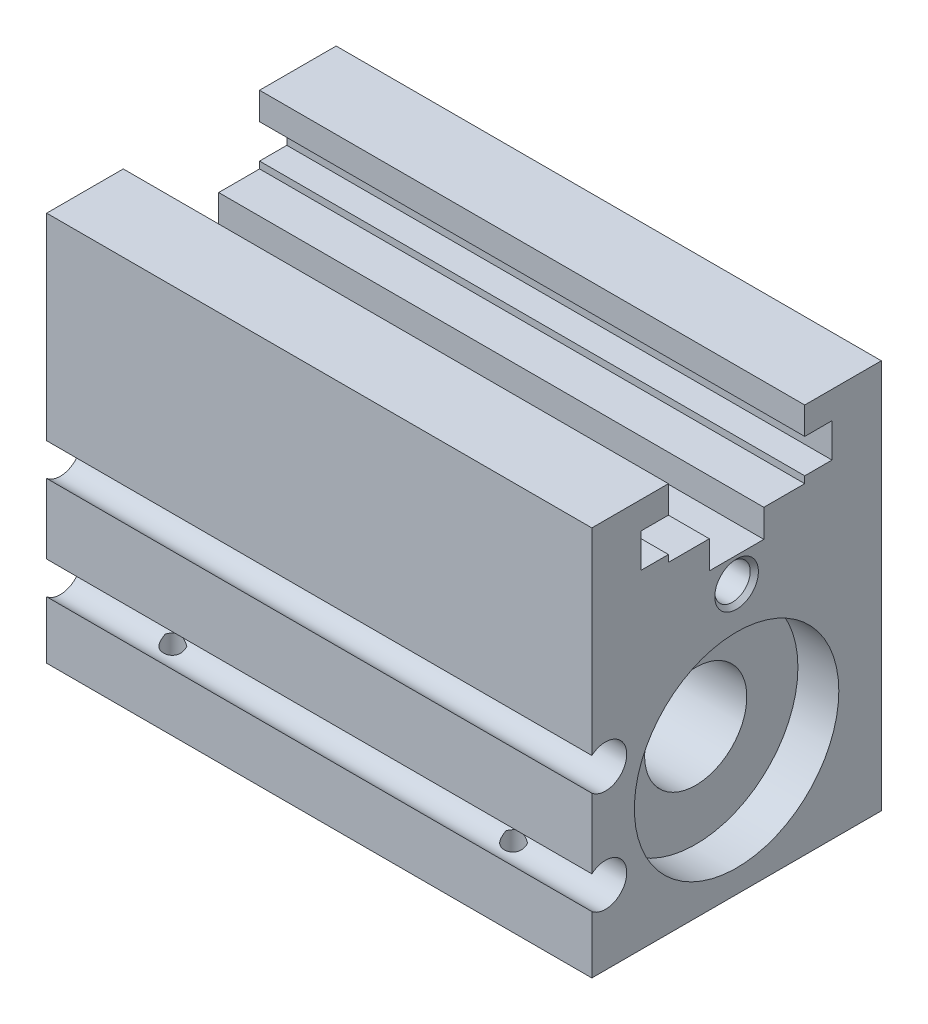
ISO-10303-21;
HEADER;
FILE_DESCRIPTION(('STEP AP214'),'2;1');
FILE_NAME('part.step','',(''),(''),'','','');
FILE_SCHEMA(('AUTOMOTIVE_DESIGN { 1 0 10303 214 1 1 1 1 }'));
ENDSEC;
DATA;
#1=APPLICATION_CONTEXT('core data for automotive mechanical design processes');
#2=APPLICATION_PROTOCOL_DEFINITION('international standard','automotive_design',2000,#1);
#3=PRODUCT_CONTEXT('',#1,'mechanical');
#4=PRODUCT('Part','Part','',(#3));
#5=PRODUCT_RELATED_PRODUCT_CATEGORY('part','',(#4));
#6=PRODUCT_DEFINITION_FORMATION('','',#4);
#7=PRODUCT_DEFINITION_CONTEXT('part definition',#1,'design');
#8=PRODUCT_DEFINITION('design','',#6,#7);
#9=PRODUCT_DEFINITION_SHAPE('','',#8);
#10=(LENGTH_UNIT() NAMED_UNIT(*) SI_UNIT(.MILLI.,.METRE.));
#11=(NAMED_UNIT(*) PLANE_ANGLE_UNIT() SI_UNIT($,.RADIAN.));
#12=(NAMED_UNIT(*) SI_UNIT($,.STERADIAN.) SOLID_ANGLE_UNIT());
#13=UNCERTAINTY_MEASURE_WITH_UNIT(LENGTH_MEASURE(1.E-05),#10,'distance_accuracy_value','');
#14=(GEOMETRIC_REPRESENTATION_CONTEXT(3) GLOBAL_UNCERTAINTY_ASSIGNED_CONTEXT((#13)) GLOBAL_UNIT_ASSIGNED_CONTEXT((#10,
#11,#12)) REPRESENTATION_CONTEXT('',''));
#15=CARTESIAN_POINT('',(0.,0.,0.));
#16=DIRECTION('',(0.,0.,1.));
#17=DIRECTION('',(1.,0.,0.));
#18=AXIS2_PLACEMENT_3D('',#15,#16,#17);
#19=CARTESIAN_POINT('',(50.8,-1.72719999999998,12.2174));
#20=DIRECTION('',(-1.,0.,0.));
#21=DIRECTION('',(0.,0.,1.));
#22=AXIS2_PLACEMENT_3D('',#19,#20,#21);
#23=PLANE('',#22);
#24=DIRECTION('',(0.,-1.,0.));
#25=VECTOR('',#24,1.);
#26=CARTESIAN_POINT('',(50.8,-12.798209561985,13.4874));
#27=LINE('',#26,#25);
#28=CARTESIAN_POINT('',(50.8,-12.798209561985,13.4874));
#29=VERTEX_POINT('',#28);
#30=CARTESIAN_POINT('',(50.8,-18.161,13.4874));
#31=VERTEX_POINT('',#30);
#32=EDGE_CURVE('E415',#29,#31,#27,.T.);
#33=ORIENTED_EDGE('',*,*,#32,.T.);
#34=DIRECTION('',(0.,0.,-1.));
#35=VECTOR('',#34,1.);
#36=CARTESIAN_POINT('',(50.8,-18.161,13.4874));
#37=LINE('',#36,#35);
#38=CARTESIAN_POINT('',(50.8,-18.161,-13.4874));
#39=VERTEX_POINT('',#38);
#40=EDGE_CURVE('E417',#31,#39,#37,.T.);
#41=ORIENTED_EDGE('',*,*,#40,.T.);
#42=DIRECTION('',(0.,1.,0.));
#43=VECTOR('',#42,1.);
#44=CARTESIAN_POINT('',(50.8,-18.161,-13.4874));
#45=LINE('',#44,#43);
#46=CARTESIAN_POINT('',(50.8,18.161,-13.4874));
#47=VERTEX_POINT('',#46);
#48=EDGE_CURVE('E420',#39,#47,#45,.T.);
#49=ORIENTED_EDGE('',*,*,#48,.T.);
#50=DIRECTION('',(0.,0.,1.));
#51=VECTOR('',#50,1.);
#52=CARTESIAN_POINT('',(50.8,18.161,-13.4874));
#53=LINE('',#52,#51);
#54=CARTESIAN_POINT('',(50.8,18.161,-6.35));
#55=VERTEX_POINT('',#54);
#56=EDGE_CURVE('E422',#47,#55,#53,.T.);
#57=ORIENTED_EDGE('',*,*,#56,.T.);
#58=DIRECTION('',(0.,-1.,0.));
#59=VECTOR('',#58,1.);
#60=CARTESIAN_POINT('',(50.8,18.161,-6.35));
#61=LINE('',#60,#59);
#62=CARTESIAN_POINT('',(50.8,15.621,-6.35));
#63=VERTEX_POINT('',#62);
#64=EDGE_CURVE('E424',#55,#63,#61,.T.);
#65=ORIENTED_EDGE('',*,*,#64,.T.);
#66=DIRECTION('',(0.,0.,-1.));
#67=VECTOR('',#66,1.);
#68=CARTESIAN_POINT('',(50.8,15.621,-6.35));
#69=LINE('',#68,#67);
#70=CARTESIAN_POINT('',(50.8,15.621,-8.89));
#71=VERTEX_POINT('',#70);
#72=EDGE_CURVE('E426',#63,#71,#69,.T.);
#73=ORIENTED_EDGE('',*,*,#72,.T.);
#74=DIRECTION('',(0.,-1.,0.));
#75=VECTOR('',#74,1.);
#76=CARTESIAN_POINT('',(50.8,15.621,-8.89));
#77=LINE('',#76,#75);
#78=CARTESIAN_POINT('',(50.8,12.446,-8.89));
#79=VERTEX_POINT('',#78);
#80=EDGE_CURVE('E428',#71,#79,#77,.T.);
#81=ORIENTED_EDGE('',*,*,#80,.T.);
#82=DIRECTION('',(0.,0.,1.));
#83=VECTOR('',#82,1.);
#84=CARTESIAN_POINT('',(50.8,12.446,-8.89));
#85=LINE('',#84,#83);
#86=CARTESIAN_POINT('',(50.8,12.446,-6.35));
#87=VERTEX_POINT('',#86);
#88=EDGE_CURVE('E430',#79,#87,#85,.T.);
#89=ORIENTED_EDGE('',*,*,#88,.T.);
#90=DIRECTION('',(0.,-1.,0.));
#91=VECTOR('',#90,1.);
#92=CARTESIAN_POINT('',(50.8,12.446,-6.35));
#93=LINE('',#92,#91);
#94=CARTESIAN_POINT('',(50.8,11.811,-6.35));
#95=VERTEX_POINT('',#94);
#96=EDGE_CURVE('E432',#87,#95,#93,.T.);
#97=ORIENTED_EDGE('',*,*,#96,.T.);
#98=DIRECTION('',(0.,0.,1.));
#99=VECTOR('',#98,1.);
#100=CARTESIAN_POINT('',(50.8,11.811,-6.35));
#101=LINE('',#100,#99);
#102=CARTESIAN_POINT('',(50.8,11.811,-2.54));
#103=VERTEX_POINT('',#102);
#104=EDGE_CURVE('E434',#95,#103,#101,.T.);
#105=ORIENTED_EDGE('',*,*,#104,.T.);
#106=DIRECTION('',(0.,-1.,0.));
#107=VECTOR('',#106,1.);
#108=CARTESIAN_POINT('',(50.8,11.811,-2.54));
#109=LINE('',#108,#107);
#110=CARTESIAN_POINT('',(50.8,9.2202,-2.54));
#111=VERTEX_POINT('',#110);
#112=EDGE_CURVE('E436',#103,#111,#109,.T.);
#113=ORIENTED_EDGE('',*,*,#112,.T.);
#114=DIRECTION('',(0.,0.,1.));
#115=VECTOR('',#114,1.);
#116=CARTESIAN_POINT('',(50.8,9.2202,-2.54));
#117=LINE('',#116,#115);
#118=CARTESIAN_POINT('',(50.8,9.2202,2.54));
#119=VERTEX_POINT('',#118);
#120=EDGE_CURVE('E438',#111,#119,#117,.T.);
#121=ORIENTED_EDGE('',*,*,#120,.T.);
#122=DIRECTION('',(0.,1.,0.));
#123=VECTOR('',#122,1.);
#124=CARTESIAN_POINT('',(50.8,9.2202,2.54));
#125=LINE('',#124,#123);
#126=CARTESIAN_POINT('',(50.8,11.811,2.54));
#127=VERTEX_POINT('',#126);
#128=EDGE_CURVE('E440',#119,#127,#125,.T.);
#129=ORIENTED_EDGE('',*,*,#128,.T.);
#130=DIRECTION('',(0.,0.,1.));
#131=VECTOR('',#130,1.);
#132=CARTESIAN_POINT('',(50.8,11.811,2.54));
#133=LINE('',#132,#131);
#134=CARTESIAN_POINT('',(50.8,11.811,6.35));
#135=VERTEX_POINT('',#134);
#136=EDGE_CURVE('E442',#127,#135,#133,.T.);
#137=ORIENTED_EDGE('',*,*,#136,.T.);
#138=DIRECTION('',(0.,1.,0.));
#139=VECTOR('',#138,1.);
#140=CARTESIAN_POINT('',(50.8,11.811,6.35));
#141=LINE('',#140,#139);
#142=CARTESIAN_POINT('',(50.8,12.446,6.35));
#143=VERTEX_POINT('',#142);
#144=EDGE_CURVE('E444',#135,#143,#141,.T.);
#145=ORIENTED_EDGE('',*,*,#144,.T.);
#146=DIRECTION('',(0.,0.,1.));
#147=VECTOR('',#146,1.);
#148=CARTESIAN_POINT('',(50.8,12.446,6.35));
#149=LINE('',#148,#147);
#150=CARTESIAN_POINT('',(50.8,12.446,8.89));
#151=VERTEX_POINT('',#150);
#152=EDGE_CURVE('E446',#143,#151,#149,.T.);
#153=ORIENTED_EDGE('',*,*,#152,.T.);
#154=DIRECTION('',(0.,1.,0.));
#155=VECTOR('',#154,1.);
#156=CARTESIAN_POINT('',(50.8,12.446,8.89));
#157=LINE('',#156,#155);
#158=CARTESIAN_POINT('',(50.8,15.621,8.89));
#159=VERTEX_POINT('',#158);
#160=EDGE_CURVE('E448',#151,#159,#157,.T.);
#161=ORIENTED_EDGE('',*,*,#160,.T.);
#162=DIRECTION('',(0.,0.,-1.));
#163=VECTOR('',#162,1.);
#164=CARTESIAN_POINT('',(50.8,15.621,8.89));
#165=LINE('',#164,#163);
#166=CARTESIAN_POINT('',(50.8,15.621,6.35));
#167=VERTEX_POINT('',#166);
#168=EDGE_CURVE('E450',#159,#167,#165,.T.);
#169=ORIENTED_EDGE('',*,*,#168,.T.);
#170=DIRECTION('',(0.,1.,0.));
#171=VECTOR('',#170,1.);
#172=CARTESIAN_POINT('',(50.8,15.621,6.35));
#173=LINE('',#172,#171);
#174=CARTESIAN_POINT('',(50.8,18.161,6.35));
#175=VERTEX_POINT('',#174);
#176=EDGE_CURVE('E452',#167,#175,#173,.T.);
#177=ORIENTED_EDGE('',*,*,#176,.T.);
#178=DIRECTION('',(0.,0.,1.));
#179=VECTOR('',#178,1.);
#180=CARTESIAN_POINT('',(50.8,18.161,6.35));
#181=LINE('',#180,#179);
#182=CARTESIAN_POINT('',(50.8,18.161,13.4874));
#183=VERTEX_POINT('',#182);
#184=EDGE_CURVE('E454',#175,#183,#181,.T.);
#185=ORIENTED_EDGE('',*,*,#184,.T.);
#186=DIRECTION('',(0.,-1.,0.));
#187=VECTOR('',#186,1.);
#188=CARTESIAN_POINT('',(50.8,18.161,13.4874));
#189=LINE('',#188,#187);
#190=CARTESIAN_POINT('',(50.8,-0.20659043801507,13.4874));
#191=VERTEX_POINT('',#190);
#192=EDGE_CURVE('E456',#183,#191,#189,.T.);
#193=ORIENTED_EDGE('',*,*,#192,.T.);
#194=CARTESIAN_POINT('',(50.8,-1.72719999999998,12.2174));
#195=DIRECTION('',(-1.,0.,0.));
#196=DIRECTION('',(0.,0.,1.));
#197=AXIS2_PLACEMENT_3D('',#194,#195,#196);
#198=CIRCLE('',#197,1.98119999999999);
#199=CARTESIAN_POINT('',(50.8,-3.2478095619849,13.4874));
#200=VERTEX_POINT('',#199);
#201=EDGE_CURVE('E458',#191,#200,#198,.T.);
#202=ORIENTED_EDGE('',*,*,#201,.T.);
#203=DIRECTION('',(0.,-1.,0.));
#204=VECTOR('',#203,1.);
#205=CARTESIAN_POINT('',(50.8,-3.2478095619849,13.4874));
#206=LINE('',#205,#204);
#207=CARTESIAN_POINT('',(50.8,-9.7569904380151,13.4874));
#208=VERTEX_POINT('',#207);
#209=EDGE_CURVE('E460',#200,#208,#206,.T.);
#210=ORIENTED_EDGE('',*,*,#209,.T.);
#211=CARTESIAN_POINT('',(50.8,-11.2776000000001,12.2174));
#212=DIRECTION('',(-1.,0.,0.));
#213=DIRECTION('',(0.,0.,1.));
#214=AXIS2_PLACEMENT_3D('',#211,#212,#213);
#215=CIRCLE('',#214,1.98120000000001);
#216=EDGE_CURVE('E462',#208,#29,#215,.T.);
#217=ORIENTED_EDGE('',*,*,#216,.T.);
#218=EDGE_LOOP('',(#33,#41,#49,#57,#65,#73,#81,#89,#97,#105,#113,#121,#129,#137,#145,#153,#161,
#169,#177,#185,#193,#202,#210,#217));
#219=FACE_BOUND('',#218,.T.);
#220=CARTESIAN_POINT('',(50.8,-6.5024,0.));
#221=DIRECTION('',(1.,0.,0.));
#222=DIRECTION('',(0.,0.,-1.));
#223=AXIS2_PLACEMENT_3D('',#220,#221,#222);
#224=CIRCLE('',#223,9.525);
#225=CARTESIAN_POINT('',(50.8,-6.5024,-9.525));
#226=VERTEX_POINT('',#225);
#227=EDGE_CURVE('E402',#226,#226,#224,.T.);
#228=ORIENTED_EDGE('',*,*,#227,.F.);
#229=EDGE_LOOP('',(#228));
#230=FACE_BOUND('',#229,.T.);
#231=CARTESIAN_POINT('',(50.8,6.8834,0.));
#232=DIRECTION('',(-1.,0.,0.));
#233=DIRECTION('',(0.,0.,1.));
#234=AXIS2_PLACEMENT_3D('',#231,#232,#233);
#235=CIRCLE('',#234,2.032);
#236=CARTESIAN_POINT('',(50.8,6.8834,2.032));
#237=VERTEX_POINT('',#236);
#238=EDGE_CURVE('E915',#237,#237,#235,.T.);
#239=ORIENTED_EDGE('',*,*,#238,.T.);
#240=EDGE_LOOP('',(#239));
#241=FACE_BOUND('',#240,.T.);
#242=ADVANCED_FACE('F33',(#219,#230,#241),#23,.F.);
#243=CARTESIAN_POINT('',(46.99,-6.5024,0.));
#244=DIRECTION('',(1.,0.,0.));
#245=DIRECTION('',(0.,0.,-1.));
#246=AXIS2_PLACEMENT_3D('',#243,#244,#245);
#247=PLANE('',#246);
#248=CARTESIAN_POINT('',(46.99,-6.5024,0.));
#249=DIRECTION('',(1.,0.,0.));
#250=DIRECTION('',(0.,0.,-1.));
#251=AXIS2_PLACEMENT_3D('',#248,#249,#250);
#252=CIRCLE('',#251,9.525);
#253=CARTESIAN_POINT('',(46.99,-6.5024,-9.525));
#254=VERTEX_POINT('',#253);
#255=EDGE_CURVE('E409',#254,#254,#252,.T.);
#256=ORIENTED_EDGE('',*,*,#255,.T.);
#257=EDGE_LOOP('',(#256));
#258=FACE_BOUND('',#257,.T.);
#259=CARTESIAN_POINT('',(46.99,-6.5024,0.));
#260=DIRECTION('',(-1.,0.,0.));
#261=DIRECTION('',(0.,0.,1.));
#262=AXIS2_PLACEMENT_3D('',#259,#260,#261);
#263=CIRCLE('',#262,4.7625);
#264=CARTESIAN_POINT('',(46.99,-6.5024,4.7625));
#265=VERTEX_POINT('',#264);
#266=EDGE_CURVE('E923',#265,#265,#263,.T.);
#267=ORIENTED_EDGE('',*,*,#266,.T.);
#268=EDGE_LOOP('',(#267));
#269=FACE_BOUND('',#268,.T.);
#270=ADVANCED_FACE('F238',(#258,#269),#247,.T.);
#271=CARTESIAN_POINT('',(0.,-1.72719999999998,12.2174));
#272=DIRECTION('',(-1.,0.,0.));
#273=DIRECTION('',(0.,0.,1.));
#274=AXIS2_PLACEMENT_3D('',#271,#272,#273);
#275=PLANE('',#274);
#276=CARTESIAN_POINT('',(0.,-6.5024,0.));
#277=DIRECTION('',(1.,0.,0.));
#278=DIRECTION('',(0.,0.,-1.));
#279=AXIS2_PLACEMENT_3D('',#276,#277,#278);
#280=CIRCLE('',#279,9.525);
#281=CARTESIAN_POINT('',(0.,-6.5024,-9.525));
#282=VERTEX_POINT('',#281);
#283=EDGE_CURVE('E619',#282,#282,#280,.T.);
#284=ORIENTED_EDGE('',*,*,#283,.T.);
#285=EDGE_LOOP('',(#284));
#286=FACE_BOUND('',#285,.T.);
#287=CARTESIAN_POINT('',(0.,8.4582,10.3251));
#288=DIRECTION('',(-1.,0.,0.));
#289=DIRECTION('',(0.,0.,1.));
#290=AXIS2_PLACEMENT_3D('',#287,#288,#289);
#291=CIRCLE('',#290,1.397);
#292=CARTESIAN_POINT('',(0.,8.4582,11.7221));
#293=VERTEX_POINT('',#292);
#294=EDGE_CURVE('E658',#293,#293,#291,.T.);
#295=ORIENTED_EDGE('',*,*,#294,.F.);
#296=EDGE_LOOP('',(#295));
#297=FACE_BOUND('',#296,.T.);
#298=CARTESIAN_POINT('',(0.,8.4582,-10.3251));
#299=DIRECTION('',(1.,0.,0.));
#300=DIRECTION('',(0.,0.,-1.));
#301=AXIS2_PLACEMENT_3D('',#298,#299,#300);
#302=CIRCLE('',#301,1.20269);
#303=CARTESIAN_POINT('',(0.,8.4582,-9.12241));
#304=VERTEX_POINT('',#303);
#305=EDGE_CURVE('E398',#304,#304,#302,.T.);
#306=ORIENTED_EDGE('',*,*,#305,.T.);
#307=EDGE_LOOP('',(#306));
#308=FACE_BOUND('',#307,.T.);
#309=DIRECTION('',(0.,-1.,0.));
#310=VECTOR('',#309,1.);
#311=CARTESIAN_POINT('',(0.,-12.798209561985,13.4874));
#312=LINE('',#311,#310);
#313=CARTESIAN_POINT('',(0.,-12.798209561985,13.4874));
#314=VERTEX_POINT('',#313);
#315=CARTESIAN_POINT('',(0.,-18.161,13.4874));
#316=VERTEX_POINT('',#315);
#317=EDGE_CURVE('E412',#314,#316,#312,.T.);
#318=ORIENTED_EDGE('',*,*,#317,.F.);
#319=CARTESIAN_POINT('',(0.,-11.2776000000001,12.2174));
#320=DIRECTION('',(-1.,0.,0.));
#321=DIRECTION('',(0.,0.,1.));
#322=AXIS2_PLACEMENT_3D('',#319,#320,#321);
#323=CIRCLE('',#322,1.98120000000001);
#324=CARTESIAN_POINT('',(0.,-9.7569904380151,13.4874));
#325=VERTEX_POINT('',#324);
#326=EDGE_CURVE('E418',#325,#314,#323,.T.);
#327=ORIENTED_EDGE('',*,*,#326,.F.);
#328=DIRECTION('',(0.,-1.,0.));
#329=VECTOR('',#328,1.);
#330=CARTESIAN_POINT('',(0.,-3.2478095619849,13.4874));
#331=LINE('',#330,#329);
#332=CARTESIAN_POINT('',(0.,-3.2478095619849,13.4874));
#333=VERTEX_POINT('',#332);
#334=EDGE_CURVE('E509',#333,#325,#331,.T.);
#335=ORIENTED_EDGE('',*,*,#334,.F.);
#336=CARTESIAN_POINT('',(0.,-1.72719999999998,12.2174));
#337=DIRECTION('',(-1.,0.,0.));
#338=DIRECTION('',(0.,0.,1.));
#339=AXIS2_PLACEMENT_3D('',#336,#337,#338);
#340=CIRCLE('',#339,1.98119999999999);
#341=CARTESIAN_POINT('',(0.,-0.20659043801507,13.4874));
#342=VERTEX_POINT('',#341);
#343=EDGE_CURVE('E507',#342,#333,#340,.T.);
#344=ORIENTED_EDGE('',*,*,#343,.F.);
#345=DIRECTION('',(0.,-1.,0.));
#346=VECTOR('',#345,1.);
#347=CARTESIAN_POINT('',(0.,18.161,13.4874));
#348=LINE('',#347,#346);
#349=CARTESIAN_POINT('',(0.,18.161,13.4874));
#350=VERTEX_POINT('',#349);
#351=EDGE_CURVE('E505',#350,#342,#348,.T.);
#352=ORIENTED_EDGE('',*,*,#351,.F.);
#353=DIRECTION('',(0.,0.,1.));
#354=VECTOR('',#353,1.);
#355=CARTESIAN_POINT('',(0.,18.161,6.35));
#356=LINE('',#355,#354);
#357=CARTESIAN_POINT('',(0.,18.161,6.35));
#358=VERTEX_POINT('',#357);
#359=EDGE_CURVE('E503',#358,#350,#356,.T.);
#360=ORIENTED_EDGE('',*,*,#359,.F.);
#361=DIRECTION('',(0.,1.,0.));
#362=VECTOR('',#361,1.);
#363=CARTESIAN_POINT('',(0.,15.621,6.35));
#364=LINE('',#363,#362);
#365=CARTESIAN_POINT('',(0.,15.621,6.35));
#366=VERTEX_POINT('',#365);
#367=EDGE_CURVE('E501',#366,#358,#364,.T.);
#368=ORIENTED_EDGE('',*,*,#367,.F.);
#369=DIRECTION('',(0.,0.,-1.));
#370=VECTOR('',#369,1.);
#371=CARTESIAN_POINT('',(0.,15.621,8.89));
#372=LINE('',#371,#370);
#373=CARTESIAN_POINT('',(0.,15.621,8.89));
#374=VERTEX_POINT('',#373);
#375=EDGE_CURVE('E499',#374,#366,#372,.T.);
#376=ORIENTED_EDGE('',*,*,#375,.F.);
#377=DIRECTION('',(0.,1.,0.));
#378=VECTOR('',#377,1.);
#379=CARTESIAN_POINT('',(0.,12.446,8.89));
#380=LINE('',#379,#378);
#381=CARTESIAN_POINT('',(0.,12.446,8.89));
#382=VERTEX_POINT('',#381);
#383=EDGE_CURVE('E497',#382,#374,#380,.T.);
#384=ORIENTED_EDGE('',*,*,#383,.F.);
#385=DIRECTION('',(0.,0.,1.));
#386=VECTOR('',#385,1.);
#387=CARTESIAN_POINT('',(0.,12.446,6.35));
#388=LINE('',#387,#386);
#389=CARTESIAN_POINT('',(0.,12.446,6.35));
#390=VERTEX_POINT('',#389);
#391=EDGE_CURVE('E495',#390,#382,#388,.T.);
#392=ORIENTED_EDGE('',*,*,#391,.F.);
#393=DIRECTION('',(0.,1.,0.));
#394=VECTOR('',#393,1.);
#395=CARTESIAN_POINT('',(0.,11.811,6.35));
#396=LINE('',#395,#394);
#397=CARTESIAN_POINT('',(0.,11.811,6.35));
#398=VERTEX_POINT('',#397);
#399=EDGE_CURVE('E493',#398,#390,#396,.T.);
#400=ORIENTED_EDGE('',*,*,#399,.F.);
#401=DIRECTION('',(0.,0.,1.));
#402=VECTOR('',#401,1.);
#403=CARTESIAN_POINT('',(0.,11.811,2.54));
#404=LINE('',#403,#402);
#405=CARTESIAN_POINT('',(0.,11.811,2.54));
#406=VERTEX_POINT('',#405);
#407=EDGE_CURVE('E491',#406,#398,#404,.T.);
#408=ORIENTED_EDGE('',*,*,#407,.F.);
#409=DIRECTION('',(0.,1.,0.));
#410=VECTOR('',#409,1.);
#411=CARTESIAN_POINT('',(0.,9.2202,2.54));
#412=LINE('',#411,#410);
#413=CARTESIAN_POINT('',(0.,9.2202,2.54));
#414=VERTEX_POINT('',#413);
#415=EDGE_CURVE('E489',#414,#406,#412,.T.);
#416=ORIENTED_EDGE('',*,*,#415,.F.);
#417=DIRECTION('',(0.,0.,1.));
#418=VECTOR('',#417,1.);
#419=CARTESIAN_POINT('',(0.,9.2202,-2.54));
#420=LINE('',#419,#418);
#421=CARTESIAN_POINT('',(0.,9.2202,-2.54));
#422=VERTEX_POINT('',#421);
#423=EDGE_CURVE('E487',#422,#414,#420,.T.);
#424=ORIENTED_EDGE('',*,*,#423,.F.);
#425=DIRECTION('',(0.,-1.,0.));
#426=VECTOR('',#425,1.);
#427=CARTESIAN_POINT('',(0.,11.811,-2.54));
#428=LINE('',#427,#426);
#429=CARTESIAN_POINT('',(0.,11.811,-2.54));
#430=VERTEX_POINT('',#429);
#431=EDGE_CURVE('E485',#430,#422,#428,.T.);
#432=ORIENTED_EDGE('',*,*,#431,.F.);
#433=DIRECTION('',(0.,0.,1.));
#434=VECTOR('',#433,1.);
#435=CARTESIAN_POINT('',(0.,11.811,-6.35));
#436=LINE('',#435,#434);
#437=CARTESIAN_POINT('',(0.,11.811,-6.35));
#438=VERTEX_POINT('',#437);
#439=EDGE_CURVE('E483',#438,#430,#436,.T.);
#440=ORIENTED_EDGE('',*,*,#439,.F.);
#441=DIRECTION('',(0.,-1.,0.));
#442=VECTOR('',#441,1.);
#443=CARTESIAN_POINT('',(0.,12.446,-6.35));
#444=LINE('',#443,#442);
#445=CARTESIAN_POINT('',(0.,12.446,-6.35));
#446=VERTEX_POINT('',#445);
#447=EDGE_CURVE('E481',#446,#438,#444,.T.);
#448=ORIENTED_EDGE('',*,*,#447,.F.);
#449=DIRECTION('',(0.,0.,1.));
#450=VECTOR('',#449,1.);
#451=CARTESIAN_POINT('',(0.,12.446,-8.89));
#452=LINE('',#451,#450);
#453=CARTESIAN_POINT('',(0.,12.446,-8.89));
#454=VERTEX_POINT('',#453);
#455=EDGE_CURVE('E479',#454,#446,#452,.T.);
#456=ORIENTED_EDGE('',*,*,#455,.F.);
#457=DIRECTION('',(0.,-1.,0.));
#458=VECTOR('',#457,1.);
#459=CARTESIAN_POINT('',(0.,15.621,-8.89));
#460=LINE('',#459,#458);
#461=CARTESIAN_POINT('',(0.,15.621,-8.89));
#462=VERTEX_POINT('',#461);
#463=EDGE_CURVE('E477',#462,#454,#460,.T.);
#464=ORIENTED_EDGE('',*,*,#463,.F.);
#465=DIRECTION('',(0.,0.,-1.));
#466=VECTOR('',#465,1.);
#467=CARTESIAN_POINT('',(0.,15.621,-6.35));
#468=LINE('',#467,#466);
#469=CARTESIAN_POINT('',(0.,15.621,-6.35));
#470=VERTEX_POINT('',#469);
#471=EDGE_CURVE('E475',#470,#462,#468,.T.);
#472=ORIENTED_EDGE('',*,*,#471,.F.);
#473=DIRECTION('',(0.,-1.,0.));
#474=VECTOR('',#473,1.);
#475=CARTESIAN_POINT('',(0.,18.161,-6.35));
#476=LINE('',#475,#474);
#477=CARTESIAN_POINT('',(0.,18.161,-6.35));
#478=VERTEX_POINT('',#477);
#479=EDGE_CURVE('E473',#478,#470,#476,.T.);
#480=ORIENTED_EDGE('',*,*,#479,.F.);
#481=DIRECTION('',(0.,0.,1.));
#482=VECTOR('',#481,1.);
#483=CARTESIAN_POINT('',(0.,18.161,-13.4874));
#484=LINE('',#483,#482);
#485=CARTESIAN_POINT('',(0.,18.161,-13.4874));
#486=VERTEX_POINT('',#485);
#487=EDGE_CURVE('E471',#486,#478,#484,.T.);
#488=ORIENTED_EDGE('',*,*,#487,.F.);
#489=DIRECTION('',(0.,1.,0.));
#490=VECTOR('',#489,1.);
#491=CARTESIAN_POINT('',(0.,-18.161,-13.4874));
#492=LINE('',#491,#490);
#493=CARTESIAN_POINT('',(0.,-18.161,-13.4874));
#494=VERTEX_POINT('',#493);
#495=EDGE_CURVE('E469',#494,#486,#492,.T.);
#496=ORIENTED_EDGE('',*,*,#495,.F.);
#497=DIRECTION('',(0.,0.,-1.));
#498=VECTOR('',#497,1.);
#499=CARTESIAN_POINT('',(0.,-18.161,13.4874));
#500=LINE('',#499,#498);
#501=EDGE_CURVE('E467',#316,#494,#500,.T.);
#502=ORIENTED_EDGE('',*,*,#501,.F.);
#503=EDGE_LOOP('',(#318,#327,#335,#344,#352,#360,#368,#376,#384,#392,#400,#408,#416,#424,#432,
#440,#448,#456,#464,#472,#480,#488,#496,#502));
#504=FACE_BOUND('',#503,.T.);
#505=CARTESIAN_POINT('',(0.,-15.367,10.3251));
#506=DIRECTION('',(1.,0.,0.));
#507=DIRECTION('',(0.,0.,-1.));
#508=AXIS2_PLACEMENT_3D('',#505,#506,#507);
#509=CIRCLE('',#508,1.20269);
#510=CARTESIAN_POINT('',(0.,-15.367,11.52779));
#511=VERTEX_POINT('',#510);
#512=EDGE_CURVE('E405',#511,#511,#509,.T.);
#513=ORIENTED_EDGE('',*,*,#512,.T.);
#514=EDGE_LOOP('',(#513));
#515=FACE_BOUND('',#514,.T.);
#516=CARTESIAN_POINT('',(0.,-15.367,-10.3251));
#517=DIRECTION('',(-1.,0.,0.));
#518=DIRECTION('',(0.,0.,1.));
#519=AXIS2_PLACEMENT_3D('',#516,#517,#518);
#520=CIRCLE('',#519,1.397);
#521=CARTESIAN_POINT('',(0.,-15.367,-8.9281));
#522=VERTEX_POINT('',#521);
#523=EDGE_CURVE('E649',#522,#522,#520,.T.);
#524=ORIENTED_EDGE('',*,*,#523,.F.);
#525=EDGE_LOOP('',(#524));
#526=FACE_BOUND('',#525,.T.);
#527=CARTESIAN_POINT('',(0.,5.360924,0.));
#528=DIRECTION('',(-1.,0.,0.));
#529=DIRECTION('',(0.,0.,1.));
#530=AXIS2_PLACEMENT_3D('',#527,#528,#529);
#531=CIRCLE('',#530,2.032);
#532=CARTESIAN_POINT('',(0.,5.360924,2.032));
#533=VERTEX_POINT('',#532);
#534=EDGE_CURVE('E669',#533,#533,#531,.T.);
#535=ORIENTED_EDGE('',*,*,#534,.F.);
#536=EDGE_LOOP('',(#535));
#537=FACE_BOUND('',#536,.T.);
#538=ADVANCED_FACE('F244',(#286,#297,#308,#504,#515,#526,#537),#275,.T.);
#539=CARTESIAN_POINT('',(50.8,-18.161,13.4874));
#540=DIRECTION('',(0.,1.,0.));
#541=DIRECTION('',(0.,0.,1.));
#542=AXIS2_PLACEMENT_3D('',#539,#540,#541);
#543=PLANE('',#542);
#544=CARTESIAN_POINT('',(34.925,-18.161,-11.1125));
#545=DIRECTION('',(0.,1.,0.));
#546=DIRECTION('',(0.,0.,1.));
#547=AXIS2_PLACEMENT_3D('',#544,#545,#546);
#548=CIRCLE('',#547,1.20269);
#549=CARTESIAN_POINT('',(34.925,-18.161,-9.90981));
#550=VERTEX_POINT('',#549);
#551=EDGE_CURVE('E683',#550,#550,#548,.T.);
#552=ORIENTED_EDGE('',*,*,#551,.T.);
#553=EDGE_LOOP('',(#552));
#554=FACE_BOUND('',#553,.T.);
#555=CARTESIAN_POINT('',(15.875,-18.161,11.1125));
#556=DIRECTION('',(0.,1.,0.));
#557=DIRECTION('',(0.,0.,1.));
#558=AXIS2_PLACEMENT_3D('',#555,#556,#557);
#559=CIRCLE('',#558,1.20269);
#560=CARTESIAN_POINT('',(15.875,-18.161,12.31519));
#561=VERTEX_POINT('',#560);
#562=EDGE_CURVE('E694',#561,#561,#559,.T.);
#563=ORIENTED_EDGE('',*,*,#562,.T.);
#564=EDGE_LOOP('',(#563));
#565=FACE_BOUND('',#564,.T.);
#566=CARTESIAN_POINT('',(41.275,-18.161,-11.1125));
#567=DIRECTION('',(0.,-1.,0.));
#568=DIRECTION('',(0.,0.,-1.));
#569=AXIS2_PLACEMENT_3D('',#566,#567,#568);
#570=CIRCLE('',#569,1.397);
#571=CARTESIAN_POINT('',(41.275,-18.1610000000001,-12.5095));
#572=VERTEX_POINT('',#571);
#573=EDGE_CURVE('E597',#572,#572,#570,.T.);
#574=ORIENTED_EDGE('',*,*,#573,.F.);
#575=EDGE_LOOP('',(#574));
#576=FACE_BOUND('',#575,.T.);
#577=CARTESIAN_POINT('',(9.525,-18.161,11.1125));
#578=DIRECTION('',(0.,-1.,0.));
#579=DIRECTION('',(0.,0.,-1.));
#580=AXIS2_PLACEMENT_3D('',#577,#578,#579);
#581=CIRCLE('',#580,1.397);
#582=CARTESIAN_POINT('',(9.525,-18.1610000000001,9.7155));
#583=VERTEX_POINT('',#582);
#584=EDGE_CURVE('E613',#583,#583,#581,.T.);
#585=ORIENTED_EDGE('',*,*,#584,.F.);
#586=EDGE_LOOP('',(#585));
#587=FACE_BOUND('',#586,.T.);
#588=ORIENTED_EDGE('',*,*,#501,.T.);
#589=DIRECTION('',(-1.,0.,0.));
#590=VECTOR('',#589,1.);
#591=CARTESIAN_POINT('',(50.8,-18.161,-13.4874));
#592=LINE('',#591,#590);
#593=EDGE_CURVE('E577',#39,#494,#592,.T.);
#594=ORIENTED_EDGE('',*,*,#593,.F.);
#595=ORIENTED_EDGE('',*,*,#40,.F.);
#596=DIRECTION('',(-1.,0.,0.));
#597=VECTOR('',#596,1.);
#598=CARTESIAN_POINT('',(50.8,-18.161,13.4874));
#599=LINE('',#598,#597);
#600=EDGE_CURVE('E580',#31,#316,#599,.T.);
#601=ORIENTED_EDGE('',*,*,#600,.T.);
#602=EDGE_LOOP('',(#588,#594,#595,#601));
#603=FACE_BOUND('',#602,.T.);
#604=CARTESIAN_POINT('',(41.275,-18.161,11.1125));
#605=DIRECTION('',(0.,-1.,0.));
#606=DIRECTION('',(0.,0.,-1.));
#607=AXIS2_PLACEMENT_3D('',#604,#605,#606);
#608=CIRCLE('',#607,1.397);
#609=CARTESIAN_POINT('',(41.275,-18.1610000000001,9.7155));
#610=VERTEX_POINT('',#609);
#611=EDGE_CURVE('E600',#610,#610,#608,.T.);
#612=ORIENTED_EDGE('',*,*,#611,.F.);
#613=EDGE_LOOP('',(#612));
#614=FACE_BOUND('',#613,.T.);
#615=CARTESIAN_POINT('',(9.525,-18.161,-11.1125));
#616=DIRECTION('',(0.,-1.,0.));
#617=DIRECTION('',(0.,0.,-1.));
#618=AXIS2_PLACEMENT_3D('',#615,#616,#617);
#619=CIRCLE('',#618,1.397);
#620=CARTESIAN_POINT('',(9.525,-18.1610000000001,-12.5095));
#621=VERTEX_POINT('',#620);
#622=EDGE_CURVE('E707',#621,#621,#619,.T.);
#623=ORIENTED_EDGE('',*,*,#622,.F.);
#624=EDGE_LOOP('',(#623));
#625=FACE_BOUND('',#624,.T.);
#626=CARTESIAN_POINT('',(34.925,-18.161,11.1125));
#627=DIRECTION('',(0.,1.,0.));
#628=DIRECTION('',(0.,0.,1.));
#629=AXIS2_PLACEMENT_3D('',#626,#627,#628);
#630=CIRCLE('',#629,1.20269);
#631=CARTESIAN_POINT('',(34.925,-18.161,12.31519));
#632=VERTEX_POINT('',#631);
#633=EDGE_CURVE('E688',#632,#632,#630,.T.);
#634=ORIENTED_EDGE('',*,*,#633,.T.);
#635=EDGE_LOOP('',(#634));
#636=FACE_BOUND('',#635,.T.);
#637=CARTESIAN_POINT('',(15.875,-18.161,-11.1125));
#638=DIRECTION('',(0.,1.,0.));
#639=DIRECTION('',(0.,0.,1.));
#640=AXIS2_PLACEMENT_3D('',#637,#638,#639);
#641=CIRCLE('',#640,1.20269);
#642=CARTESIAN_POINT('',(15.875,-18.161,-9.90981));
#643=VERTEX_POINT('',#642);
#644=EDGE_CURVE('E671',#643,#643,#641,.T.);
#645=ORIENTED_EDGE('',*,*,#644,.T.);
#646=EDGE_LOOP('',(#645));
#647=FACE_BOUND('',#646,.T.);
#648=ADVANCED_FACE('F253',(#554,#565,#576,#587,#603,#614,#625,#636,#647),#543,.F.);
#649=CARTESIAN_POINT('',(50.8,-11.2776000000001,12.2174));
#650=DIRECTION('',(-1.,0.,0.));
#651=DIRECTION('',(0.,0.,1.));
#652=AXIS2_PLACEMENT_3D('',#649,#650,#651);
#653=CYLINDRICAL_SURFACE('',#652,1.98120000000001);
#654=CARTESIAN_POINT('',(8.52138413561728,-12.803987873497,10.9543507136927));
#655=CARTESIAN_POINT('',(8.51753120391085,-12.8242332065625,10.9788160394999));
#656=CARTESIAN_POINT('',(8.51450306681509,-12.8439491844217,11.0038430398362));
#657=CARTESIAN_POINT('',(8.51030618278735,-12.8822413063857,11.0549449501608));
#658=CARTESIAN_POINT('',(8.50913947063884,-12.9008161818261,11.0810209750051));
#659=CARTESIAN_POINT('',(8.50875577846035,-12.9548343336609,11.1609108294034));
#660=CARTESIAN_POINT('',(8.51270120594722,-12.9883519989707,11.216122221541));
#661=CARTESIAN_POINT('',(8.53062944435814,-13.0494752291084,11.3287249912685));
#662=CARTESIAN_POINT('',(8.54468193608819,-13.0770380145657,11.3861288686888));
#663=CARTESIAN_POINT('',(8.583822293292,-13.1253159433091,11.4998387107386));
#664=CARTESIAN_POINT('',(8.60886727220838,-13.1460571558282,11.5561480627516));
#665=CARTESIAN_POINT('',(8.66560386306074,-13.1785506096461,11.6570800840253));
#666=CARTESIAN_POINT('',(8.69587322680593,-13.1911549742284,11.7022349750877));
#667=CARTESIAN_POINT('',(8.76386874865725,-13.2121453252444,11.7877169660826));
#668=CARTESIAN_POINT('',(8.80160137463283,-13.2205276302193,11.8280398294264));
#669=CARTESIAN_POINT('',(8.88180546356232,-13.2336718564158,11.9007725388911));
#670=CARTESIAN_POINT('',(8.92402997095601,-13.2385640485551,11.933432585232));
#671=CARTESIAN_POINT('',(9.01320091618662,-13.2461331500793,11.9917935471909));
#672=CARTESIAN_POINT('',(9.06014660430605,-13.2488104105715,12.0174955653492));
#673=CARTESIAN_POINT('',(9.15938795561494,-13.252832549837,12.062054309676));
#674=CARTESIAN_POINT('',(9.2118189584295,-13.2541230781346,12.0806146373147));
#675=CARTESIAN_POINT('',(9.31902256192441,-13.2558805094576,12.1089459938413));
#676=CARTESIAN_POINT('',(9.37379562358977,-13.2563472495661,12.1187152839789));
#677=CARTESIAN_POINT('',(9.48559532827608,-13.2568490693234,12.129325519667));
#678=CARTESIAN_POINT('',(9.54264402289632,-13.2568730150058,12.1299361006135));
#679=CARTESIAN_POINT('',(9.65604288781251,-13.2564874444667,12.1216166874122));
#680=CARTESIAN_POINT('',(9.71239300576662,-13.2560778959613,12.1126859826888));
#681=CARTESIAN_POINT('',(9.82299884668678,-13.2544504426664,12.0854888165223));
#682=CARTESIAN_POINT('',(9.87724635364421,-13.2532296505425,12.0671890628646));
#683=CARTESIAN_POINT('',(9.98186339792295,-13.2492493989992,12.0217759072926));
#684=CARTESIAN_POINT('',(10.0322330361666,-13.2464899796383,11.9946627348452));
#685=CARTESIAN_POINT('',(10.1271329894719,-13.2384948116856,11.9327858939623));
#686=CARTESIAN_POINT('',(10.1717146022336,-13.233283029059,11.8980979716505));
#687=CARTESIAN_POINT('',(10.2542400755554,-13.2193561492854,11.8221520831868));
#688=CARTESIAN_POINT('',(10.2921860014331,-13.2106421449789,11.7808961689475));
#689=CARTESIAN_POINT('',(10.3591061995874,-13.1891950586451,11.6950599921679));
#690=CARTESIAN_POINT('',(10.3883572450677,-13.1766201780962,11.6506558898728));
#691=CARTESIAN_POINT('',(10.4390864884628,-13.1468483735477,11.5590866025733));
#692=CARTESIAN_POINT('',(10.4605693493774,-13.1296542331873,11.5119230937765));
#693=CARTESIAN_POINT('',(10.4953733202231,-13.0909069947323,11.4176387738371));
#694=CARTESIAN_POINT('',(10.5088477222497,-13.0694470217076,11.3705356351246));
#695=CARTESIAN_POINT('',(10.5287426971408,-13.0221609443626,11.2769668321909));
#696=CARTESIAN_POINT('',(10.535151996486,-12.996327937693,11.2305023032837));
#697=CARTESIAN_POINT('',(10.5413038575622,-12.9438716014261,11.144582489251));
#698=CARTESIAN_POINT('',(10.541705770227,-12.9176521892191,11.1049206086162));
#699=CARTESIAN_POINT('',(10.5382006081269,-12.8626568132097,11.0278616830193));
#700=CARTESIAN_POINT('',(10.5343124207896,-12.8338925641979,10.9904554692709));
#701=CARTESIAN_POINT('',(10.5286158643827,-12.803987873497,10.9543507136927));
#702=B_SPLINE_CURVE_WITH_KNOTS('',3,(#654,#655,#656,#657,#658,#659,#660,#661,#662,#663,#664,
#665,#666,#667,#668,#669,#670,#671,#672,#673,#674,#675,#676,#677,#678,#679,#680,#681,#682,#683,
#684,#685,#686,#687,#688,#689,#690,#691,#692,#693,#694,#695,#696,#697,#698,#699,#700,#701),
.UNSPECIFIED.,.F.,.F.,(4,2,2,2,2,2,2,2,2,2,2,2,2,2,2,2,2,2,2,2,2,2,2,4),(0.,0.0959294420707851,
0.191963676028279,0.385059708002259,0.579499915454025,0.773188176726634,0.939748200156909,
1.10645320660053,1.26655395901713,1.42662932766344,1.59277234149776,1.75894820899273,
1.92929700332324,2.0996584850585,2.27062957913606,2.44159622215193,2.61092571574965,
2.7802024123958,2.94330429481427,3.10630810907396,3.26608196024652,3.42611038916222,
3.56842715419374,3.7101198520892),.UNSPECIFIED.);
#703=CARTESIAN_POINT('',(8.52138413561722,-12.803987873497,10.9543507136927));
#704=VERTEX_POINT('',#703);
#705=CARTESIAN_POINT('',(10.5286158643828,-12.803987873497,10.9543507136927));
#706=VERTEX_POINT('',#705);
#707=EDGE_CURVE('E274',#704,#706,#702,.T.);
#708=ORIENTED_EDGE('',*,*,#707,.F.);
#709=CARTESIAN_POINT('',(10.6398283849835,-12.8628466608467,11.0290623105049));
#710=CARTESIAN_POINT('',(10.615867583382,-12.8498036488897,11.0116648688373));
#711=CARTESIAN_POINT('',(10.5914779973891,-12.8367662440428,10.9948677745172));
#712=CARTESIAN_POINT('',(10.5419128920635,-12.810770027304,10.9624193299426));
#713=CARTESIAN_POINT('',(10.516737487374,-12.7978112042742,10.9467678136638));
#714=CARTESIAN_POINT('',(10.439978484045,-12.7590718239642,10.9013526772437));
#715=CARTESIAN_POINT('',(10.3873044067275,-12.7335061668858,10.8732305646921));
#716=CARTESIAN_POINT('',(10.2769697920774,-12.6825569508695,10.8200227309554));
#717=CARTESIAN_POINT('',(10.2191917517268,-12.6572314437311,10.7951262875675));
#718=CARTESIAN_POINT('',(10.100794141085,-12.6092273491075,10.7500907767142));
#719=CARTESIAN_POINT('',(10.0401789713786,-12.586544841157,10.7299446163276));
#720=CARTESIAN_POINT('',(9.94915261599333,-12.5568711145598,10.7045302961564));
#721=CARTESIAN_POINT('',(9.91996550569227,-12.5479856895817,10.6970752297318));
#722=CARTESIAN_POINT('',(9.86089549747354,-12.5315829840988,10.683518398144));
#723=CARTESIAN_POINT('',(9.8310127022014,-12.5240655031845,10.6774164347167));
#724=CARTESIAN_POINT('',(9.77094200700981,-12.5108488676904,10.666812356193));
#725=CARTESIAN_POINT('',(9.74076192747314,-12.5051292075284,10.662292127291));
#726=CARTESIAN_POINT('',(9.67987966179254,-12.495769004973,10.6549488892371));
#727=CARTESIAN_POINT('',(9.64917769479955,-12.4921276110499,10.6521251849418));
#728=CARTESIAN_POINT('',(9.58695574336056,-12.4871845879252,10.648301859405));
#729=CARTESIAN_POINT('',(9.55543060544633,-12.4859223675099,10.647332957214));
#730=CARTESIAN_POINT('',(9.49238622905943,-12.4859814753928,10.647378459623));
#731=CARTESIAN_POINT('',(9.46086699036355,-12.4873026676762,10.6483927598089));
#732=CARTESIAN_POINT('',(9.39800404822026,-12.4924106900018,10.6523445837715));
#733=CARTESIAN_POINT('',(9.36666192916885,-12.4962094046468,10.6552913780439));
#734=CARTESIAN_POINT('',(9.30452693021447,-12.5059578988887,10.6629456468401));
#735=CARTESIAN_POINT('',(9.27373437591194,-12.5119089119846,10.6676541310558));
#736=CARTESIAN_POINT('',(9.19969142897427,-12.5284997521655,10.680988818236));
#737=CARTESIAN_POINT('',(9.15679508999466,-12.5400548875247,10.6904288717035));
#738=CARTESIAN_POINT('',(9.07243923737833,-12.5656520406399,10.7119581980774));
#739=CARTESIAN_POINT('',(9.03098070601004,-12.5796957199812,10.7240492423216));
#740=CARTESIAN_POINT('',(8.94928410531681,-12.6095116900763,10.7505786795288));
#741=CARTESIAN_POINT('',(8.90905101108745,-12.6252900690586,10.7650254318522));
#742=CARTESIAN_POINT('',(8.8299096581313,-12.6579650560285,10.7960437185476));
#743=CARTESIAN_POINT('',(8.7910009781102,-12.6748613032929,10.8126145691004));
#744=CARTESIAN_POINT('',(8.69187719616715,-12.7195693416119,10.8582037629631));
#745=CARTESIAN_POINT('',(8.63262641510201,-12.7479430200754,10.8888004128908));
#746=CARTESIAN_POINT('',(8.5467322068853,-12.7909280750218,10.9385464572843));
#747=CARTESIAN_POINT('',(8.51874512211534,-12.8052465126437,10.9556647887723));
#748=CARTESIAN_POINT('',(8.46372180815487,-12.8339894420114,10.9912975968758));
#749=CARTESIAN_POINT('',(8.43668577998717,-12.8484139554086,11.009812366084));
#750=CARTESIAN_POINT('',(8.41017161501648,-12.8628466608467,11.0290623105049));
#751=B_SPLINE_CURVE_WITH_KNOTS('',3,(#709,#710,#711,#712,#713,#714,#715,#716,#717,#718,#719,
#720,#721,#722,#723,#724,#725,#726,#727,#728,#729,#730,#731,#732,#733,#734,#735,#736,#737,#738,
#739,#740,#741,#742,#743,#744,#745,#746,#747,#748,#749,#750),.UNSPECIFIED.,.F.,.F.,(4,2,2,2,2,2,
2,2,2,2,2,2,2,2,2,2,2,2,2,2,4),(0.,0.0970467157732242,0.194079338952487,0.388717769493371,
0.591963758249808,0.794904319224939,0.889075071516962,0.983232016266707,1.0762723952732,
1.16927462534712,1.26380425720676,1.35832891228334,1.45331036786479,1.54834634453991,
1.68436525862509,1.82047533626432,1.95707936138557,2.09363951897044,2.3107201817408,
2.41807457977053,2.52545153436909),.UNSPECIFIED.);
#752=EDGE_CURVE('E266',#706,#704,#751,.T.);
#753=ORIENTED_EDGE('',*,*,#752,.F.);
#754=EDGE_LOOP('',(#708,#753));
#755=FACE_BOUND('',#754,.T.);
#756=ORIENTED_EDGE('',*,*,#326,.T.);
#757=DIRECTION('',(-1.,0.,0.));
#758=VECTOR('',#757,1.);
#759=CARTESIAN_POINT('',(50.8,-12.798209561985,13.4874));
#760=LINE('',#759,#758);
#761=EDGE_CURVE('E464',#29,#314,#760,.T.);
#762=ORIENTED_EDGE('',*,*,#761,.F.);
#763=ORIENTED_EDGE('',*,*,#216,.F.);
#764=DIRECTION('',(-1.,0.,0.));
#765=VECTOR('',#764,1.);
#766=CARTESIAN_POINT('',(50.8,-9.7569904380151,13.4874));
#767=LINE('',#766,#765);
#768=EDGE_CURVE('E514',#208,#325,#767,.T.);
#769=ORIENTED_EDGE('',*,*,#768,.T.);
#770=EDGE_LOOP('',(#756,#762,#763,#769));
#771=FACE_BOUND('',#770,.T.);
#772=CARTESIAN_POINT('',(40.2713841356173,-12.803987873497,10.9543507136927));
#773=CARTESIAN_POINT('',(40.2675312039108,-12.8242332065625,10.9788160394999));
#774=CARTESIAN_POINT('',(40.2645030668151,-12.8439491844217,11.0038430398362));
#775=CARTESIAN_POINT('',(40.2603061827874,-12.8822413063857,11.0549449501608));
#776=CARTESIAN_POINT('',(40.2591394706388,-12.9008161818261,11.0810209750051));
#777=CARTESIAN_POINT('',(40.2587557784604,-12.9548343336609,11.1609108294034));
#778=CARTESIAN_POINT('',(40.2627012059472,-12.9883519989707,11.216122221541));
#779=CARTESIAN_POINT('',(40.2806294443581,-13.0494752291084,11.3287249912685));
#780=CARTESIAN_POINT('',(40.2946819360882,-13.0770380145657,11.3861288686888));
#781=CARTESIAN_POINT('',(40.333822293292,-13.1253159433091,11.4998387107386));
#782=CARTESIAN_POINT('',(40.3588672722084,-13.1460571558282,11.5561480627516));
#783=CARTESIAN_POINT('',(40.4156038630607,-13.1785506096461,11.6570800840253));
#784=CARTESIAN_POINT('',(40.4458732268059,-13.1911549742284,11.7022349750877));
#785=CARTESIAN_POINT('',(40.5138687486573,-13.2121453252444,11.7877169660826));
#786=CARTESIAN_POINT('',(40.5516013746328,-13.2205276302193,11.8280398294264));
#787=CARTESIAN_POINT('',(40.6318054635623,-13.2336718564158,11.9007725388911));
#788=CARTESIAN_POINT('',(40.674029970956,-13.2385640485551,11.933432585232));
#789=CARTESIAN_POINT('',(40.7632009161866,-13.2461331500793,11.9917935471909));
#790=CARTESIAN_POINT('',(40.8101466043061,-13.2488104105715,12.0174955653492));
#791=CARTESIAN_POINT('',(40.9093879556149,-13.252832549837,12.062054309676));
#792=CARTESIAN_POINT('',(40.9618189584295,-13.2541230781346,12.0806146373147));
#793=CARTESIAN_POINT('',(41.0690225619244,-13.2558805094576,12.1089459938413));
#794=CARTESIAN_POINT('',(41.1237956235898,-13.2563472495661,12.1187152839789));
#795=CARTESIAN_POINT('',(41.2355953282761,-13.2568490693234,12.129325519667));
#796=CARTESIAN_POINT('',(41.2926440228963,-13.2568730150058,12.1299361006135));
#797=CARTESIAN_POINT('',(41.4060428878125,-13.2564874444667,12.1216166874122));
#798=CARTESIAN_POINT('',(41.4623930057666,-13.2560778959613,12.1126859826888));
#799=CARTESIAN_POINT('',(41.5729988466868,-13.2544504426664,12.0854888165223));
#800=CARTESIAN_POINT('',(41.6272463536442,-13.2532296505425,12.0671890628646));
#801=CARTESIAN_POINT('',(41.7318633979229,-13.2492493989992,12.0217759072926));
#802=CARTESIAN_POINT('',(41.7822330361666,-13.2464899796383,11.9946627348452));
#803=CARTESIAN_POINT('',(41.8771329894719,-13.2384948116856,11.9327858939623));
#804=CARTESIAN_POINT('',(41.9217146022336,-13.233283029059,11.8980979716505));
#805=CARTESIAN_POINT('',(42.0042400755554,-13.2193561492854,11.8221520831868));
#806=CARTESIAN_POINT('',(42.0421860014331,-13.2106421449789,11.7808961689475));
#807=CARTESIAN_POINT('',(42.1091061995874,-13.1891950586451,11.6950599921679));
#808=CARTESIAN_POINT('',(42.1383572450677,-13.1766201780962,11.6506558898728));
#809=CARTESIAN_POINT('',(42.1890864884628,-13.1468483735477,11.5590866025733));
#810=CARTESIAN_POINT('',(42.2105693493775,-13.1296542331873,11.5119230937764));
#811=CARTESIAN_POINT('',(42.2453733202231,-13.0909069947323,11.4176387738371));
#812=CARTESIAN_POINT('',(42.2588477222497,-13.0694470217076,11.3705356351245));
#813=CARTESIAN_POINT('',(42.2787426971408,-13.0221609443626,11.2769668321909));
#814=CARTESIAN_POINT('',(42.285151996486,-12.996327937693,11.2305023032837));
#815=CARTESIAN_POINT('',(42.2913038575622,-12.9438716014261,11.1445824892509));
#816=CARTESIAN_POINT('',(42.291705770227,-12.9176521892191,11.1049206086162));
#817=CARTESIAN_POINT('',(42.2882006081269,-12.8626568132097,11.0278616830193));
#818=CARTESIAN_POINT('',(42.2843124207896,-12.8338925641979,10.9904554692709));
#819=CARTESIAN_POINT('',(42.2786158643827,-12.803987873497,10.9543507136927));
#820=B_SPLINE_CURVE_WITH_KNOTS('',3,(#772,#773,#774,#775,#776,#777,#778,#779,#780,#781,#782,
#783,#784,#785,#786,#787,#788,#789,#790,#791,#792,#793,#794,#795,#796,#797,#798,#799,#800,#801,
#802,#803,#804,#805,#806,#807,#808,#809,#810,#811,#812,#813,#814,#815,#816,#817,#818,#819),
.UNSPECIFIED.,.F.,.F.,(4,2,2,2,2,2,2,2,2,2,2,2,2,2,2,2,2,2,2,2,2,2,2,4),(0.,0.0959294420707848,
0.191963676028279,0.38505970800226,0.579499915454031,0.773188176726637,0.939748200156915,
1.10645320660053,1.26655395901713,1.42662932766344,1.59277234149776,1.75894820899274,
1.92929700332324,2.0996584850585,2.27062957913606,2.44159622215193,2.61092571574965,
2.78020241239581,2.94330429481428,3.10630810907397,3.26608196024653,3.42611038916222,
3.56842715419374,3.7101198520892),.UNSPECIFIED.);
#821=CARTESIAN_POINT('',(40.2713841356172,-12.803987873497,10.9543507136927));
#822=VERTEX_POINT('',#821);
#823=CARTESIAN_POINT('',(42.2786158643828,-12.803987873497,10.9543507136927));
#824=VERTEX_POINT('',#823);
#825=EDGE_CURVE('E11',#822,#824,#820,.T.);
#826=ORIENTED_EDGE('',*,*,#825,.F.);
#827=CARTESIAN_POINT('',(42.3898283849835,-12.8628466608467,11.0290623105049));
#828=CARTESIAN_POINT('',(42.365867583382,-12.8498036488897,11.0116648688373));
#829=CARTESIAN_POINT('',(42.3414779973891,-12.8367662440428,10.9948677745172));
#830=CARTESIAN_POINT('',(42.2919128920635,-12.810770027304,10.9624193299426));
#831=CARTESIAN_POINT('',(42.2667374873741,-12.7978112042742,10.9467678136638));
#832=CARTESIAN_POINT('',(42.189978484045,-12.7590718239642,10.9013526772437));
#833=CARTESIAN_POINT('',(42.1373044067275,-12.7335061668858,10.8732305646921));
#834=CARTESIAN_POINT('',(42.0269697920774,-12.6825569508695,10.8200227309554));
#835=CARTESIAN_POINT('',(41.9691917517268,-12.6572314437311,10.7951262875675));
#836=CARTESIAN_POINT('',(41.850794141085,-12.6092273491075,10.7500907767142));
#837=CARTESIAN_POINT('',(41.7901789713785,-12.586544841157,10.7299446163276));
#838=CARTESIAN_POINT('',(41.6991526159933,-12.5568711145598,10.7045302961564));
#839=CARTESIAN_POINT('',(41.6699655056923,-12.5479856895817,10.6970752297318));
#840=CARTESIAN_POINT('',(41.6108954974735,-12.5315829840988,10.683518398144));
#841=CARTESIAN_POINT('',(41.5810127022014,-12.5240655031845,10.6774164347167));
#842=CARTESIAN_POINT('',(41.5209420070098,-12.5108488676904,10.666812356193));
#843=CARTESIAN_POINT('',(41.4907619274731,-12.5051292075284,10.662292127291));
#844=CARTESIAN_POINT('',(41.4298796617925,-12.495769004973,10.6549488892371));
#845=CARTESIAN_POINT('',(41.3991776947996,-12.4921276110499,10.6521251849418));
#846=CARTESIAN_POINT('',(41.3369557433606,-12.4871845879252,10.648301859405));
#847=CARTESIAN_POINT('',(41.3054306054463,-12.4859223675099,10.647332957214));
#848=CARTESIAN_POINT('',(41.2423862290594,-12.4859814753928,10.647378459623));
#849=CARTESIAN_POINT('',(41.2108669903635,-12.4873026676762,10.6483927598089));
#850=CARTESIAN_POINT('',(41.1480040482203,-12.4924106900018,10.6523445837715));
#851=CARTESIAN_POINT('',(41.1166619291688,-12.4962094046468,10.6552913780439));
#852=CARTESIAN_POINT('',(41.0545269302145,-12.5059578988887,10.6629456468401));
#853=CARTESIAN_POINT('',(41.0237343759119,-12.5119089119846,10.6676541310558));
#854=CARTESIAN_POINT('',(40.9496914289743,-12.5284997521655,10.680988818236));
#855=CARTESIAN_POINT('',(40.9067950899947,-12.5400548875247,10.6904288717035));
#856=CARTESIAN_POINT('',(40.8224392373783,-12.5656520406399,10.7119581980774));
#857=CARTESIAN_POINT('',(40.78098070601,-12.5796957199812,10.7240492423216));
#858=CARTESIAN_POINT('',(40.6992841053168,-12.6095116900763,10.7505786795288));
#859=CARTESIAN_POINT('',(40.6590510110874,-12.6252900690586,10.7650254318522));
#860=CARTESIAN_POINT('',(40.5799096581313,-12.6579650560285,10.7960437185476));
#861=CARTESIAN_POINT('',(40.5410009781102,-12.6748613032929,10.8126145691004));
#862=CARTESIAN_POINT('',(40.4418771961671,-12.7195693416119,10.8582037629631));
#863=CARTESIAN_POINT('',(40.382626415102,-12.7479430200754,10.8888004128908));
#864=CARTESIAN_POINT('',(40.2967322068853,-12.7909280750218,10.9385464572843));
#865=CARTESIAN_POINT('',(40.2687451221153,-12.8052465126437,10.9556647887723));
#866=CARTESIAN_POINT('',(40.2137218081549,-12.8339894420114,10.9912975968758));
#867=CARTESIAN_POINT('',(40.1866857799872,-12.8484139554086,11.009812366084));
#868=CARTESIAN_POINT('',(40.1601716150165,-12.8628466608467,11.0290623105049));
#869=B_SPLINE_CURVE_WITH_KNOTS('',3,(#827,#828,#829,#830,#831,#832,#833,#834,#835,#836,#837,
#838,#839,#840,#841,#842,#843,#844,#845,#846,#847,#848,#849,#850,#851,#852,#853,#854,#855,#856,
#857,#858,#859,#860,#861,#862,#863,#864,#865,#866,#867,#868),.UNSPECIFIED.,.F.,.F.,(4,2,2,2,2,2,
2,2,2,2,2,2,2,2,2,2,2,2,2,2,4),(0.,0.0970467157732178,0.194079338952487,0.388717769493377,
0.59196375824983,0.794904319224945,0.889075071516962,0.983232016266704,1.0762723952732,
1.16927462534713,1.26380425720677,1.35832891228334,1.4533103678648,1.54834634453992,
1.68436525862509,1.82047533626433,1.95707936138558,2.09363951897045,2.31072018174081,
2.41807457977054,2.52545153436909),.UNSPECIFIED.);
#870=EDGE_CURVE('E46',#824,#822,#869,.T.);
#871=ORIENTED_EDGE('',*,*,#870,.F.);
#872=EDGE_LOOP('',(#826,#871));
#873=FACE_BOUND('',#872,.T.);
#874=ADVANCED_FACE('F255',(#755,#771,#873),#653,.F.);
#875=CARTESIAN_POINT('',(3.81,-6.5024,0.));
#876=DIRECTION('',(1.,0.,0.));
#877=DIRECTION('',(0.,0.,-1.));
#878=AXIS2_PLACEMENT_3D('',#875,#876,#877);
#879=PLANE('',#878);
#880=CARTESIAN_POINT('',(3.81,-6.5024,0.));
#881=DIRECTION('',(1.,0.,0.));
#882=DIRECTION('',(0.,0.,-1.));
#883=AXIS2_PLACEMENT_3D('',#880,#881,#882);
#884=CIRCLE('',#883,9.525);
#885=CARTESIAN_POINT('',(3.81,-6.5024,-9.525));
#886=VERTEX_POINT('',#885);
#887=EDGE_CURVE('E620',#886,#886,#884,.T.);
#888=ORIENTED_EDGE('',*,*,#887,.F.);
#889=EDGE_LOOP('',(#888));
#890=FACE_BOUND('',#889,.T.);
#891=CARTESIAN_POINT('',(3.81,-6.5024,0.));
#892=DIRECTION('',(1.,0.,0.));
#893=DIRECTION('',(0.,0.,-1.));
#894=AXIS2_PLACEMENT_3D('',#891,#892,#893);
#895=CIRCLE('',#894,9.3345);
#896=CARTESIAN_POINT('',(3.81,-6.5024,-9.3345));
#897=VERTEX_POINT('',#896);
#898=EDGE_CURVE('E582',#897,#897,#895,.F.);
#899=ORIENTED_EDGE('',*,*,#898,.F.);
#900=EDGE_LOOP('',(#899));
#901=FACE_BOUND('',#900,.T.);
#902=ADVANCED_FACE('F259',(#890,#901),#879,.F.);
#903=CARTESIAN_POINT('',(50.8,-18.161,-13.4874));
#904=DIRECTION('',(0.,0.,1.));
#905=DIRECTION('',(1.,0.,0.));
#906=AXIS2_PLACEMENT_3D('',#903,#904,#905);
#907=PLANE('',#906);
#908=CARTESIAN_POINT('',(5.715,3.8862,-13.4874));
#909=DIRECTION('',(0.,0.,1.));
#910=DIRECTION('',(1.,0.,0.));
#911=AXIS2_PLACEMENT_3D('',#908,#909,#910);
#912=CIRCLE('',#911,2.413);
#913=CARTESIAN_POINT('',(8.128,3.8862,-13.4874));
#914=VERTEX_POINT('',#913);
#915=EDGE_CURVE('E634',#914,#914,#912,.T.);
#916=ORIENTED_EDGE('',*,*,#915,.T.);
#917=EDGE_LOOP('',(#916));
#918=FACE_BOUND('',#917,.T.);
#919=ORIENTED_EDGE('',*,*,#495,.T.);
#920=DIRECTION('',(-1.,0.,0.));
#921=VECTOR('',#920,1.);
#922=CARTESIAN_POINT('',(50.8,18.161,-13.4874));
#923=LINE('',#922,#921);
#924=EDGE_CURVE('E574',#47,#486,#923,.T.);
#925=ORIENTED_EDGE('',*,*,#924,.F.);
#926=ORIENTED_EDGE('',*,*,#48,.F.);
#927=ORIENTED_EDGE('',*,*,#593,.T.);
#928=EDGE_LOOP('',(#919,#925,#926,#927));
#929=FACE_BOUND('',#928,.T.);
#930=CARTESIAN_POINT('',(43.4975,3.8862,-13.4874));
#931=DIRECTION('',(0.,0.,1.));
#932=DIRECTION('',(1.,0.,0.));
#933=AXIS2_PLACEMENT_3D('',#930,#931,#932);
#934=CIRCLE('',#933,2.413);
#935=CARTESIAN_POINT('',(45.9105,3.8862,-13.4874));
#936=VERTEX_POINT('',#935);
#937=EDGE_CURVE('E623',#936,#936,#934,.T.);
#938=ORIENTED_EDGE('',*,*,#937,.T.);
#939=EDGE_LOOP('',(#938));
#940=FACE_BOUND('',#939,.T.);
#941=ADVANCED_FACE('F320',(#918,#929,#940),#907,.F.);
#942=CARTESIAN_POINT('',(50.8,-12.798209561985,13.4874));
#943=DIRECTION('',(0.,0.,-1.));
#944=DIRECTION('',(-1.,0.,0.));
#945=AXIS2_PLACEMENT_3D('',#942,#943,#944);
#946=PLANE('',#945);
#947=ORIENTED_EDGE('',*,*,#317,.T.);
#948=ORIENTED_EDGE('',*,*,#600,.F.);
#949=ORIENTED_EDGE('',*,*,#32,.F.);
#950=ORIENTED_EDGE('',*,*,#761,.T.);
#951=EDGE_LOOP('',(#947,#948,#949,#950));
#952=FACE_BOUND('',#951,.T.);
#953=ADVANCED_FACE('F35',(#952),#946,.F.);
#954=CARTESIAN_POINT('',(50.8,18.161,-13.4874));
#955=DIRECTION('',(0.,-1.,0.));
#956=DIRECTION('',(0.,0.,-1.));
#957=AXIS2_PLACEMENT_3D('',#954,#955,#956);
#958=PLANE('',#957);
#959=ORIENTED_EDGE('',*,*,#487,.T.);
#960=DIRECTION('',(-1.,0.,0.));
#961=VECTOR('',#960,1.);
#962=CARTESIAN_POINT('',(50.8,18.161,-6.35));
#963=LINE('',#962,#961);
#964=EDGE_CURVE('E571',#55,#478,#963,.T.);
#965=ORIENTED_EDGE('',*,*,#964,.F.);
#966=ORIENTED_EDGE('',*,*,#56,.F.);
#967=ORIENTED_EDGE('',*,*,#924,.T.);
#968=EDGE_LOOP('',(#959,#965,#966,#967));
#969=FACE_BOUND('',#968,.T.);
#970=ADVANCED_FACE('F964',(#969),#958,.F.);
#971=CARTESIAN_POINT('',(50.8,18.161,-6.35));
#972=DIRECTION('',(0.,0.,-1.));
#973=DIRECTION('',(-1.,0.,0.));
#974=AXIS2_PLACEMENT_3D('',#971,#972,#973);
#975=PLANE('',#974);
#976=ORIENTED_EDGE('',*,*,#479,.T.);
#977=DIRECTION('',(-1.,0.,0.));
#978=VECTOR('',#977,1.);
#979=CARTESIAN_POINT('',(50.8,15.621,-6.35));
#980=LINE('',#979,#978);
#981=EDGE_CURVE('E568',#63,#470,#980,.T.);
#982=ORIENTED_EDGE('',*,*,#981,.F.);
#983=ORIENTED_EDGE('',*,*,#64,.F.);
#984=ORIENTED_EDGE('',*,*,#964,.T.);
#985=EDGE_LOOP('',(#976,#982,#983,#984));
#986=FACE_BOUND('',#985,.T.);
#987=ADVANCED_FACE('F971',(#986),#975,.F.);
#988=CARTESIAN_POINT('',(50.8,15.621,-6.35));
#989=DIRECTION('',(0.,1.,0.));
#990=DIRECTION('',(0.,0.,1.));
#991=AXIS2_PLACEMENT_3D('',#988,#989,#990);
#992=PLANE('',#991);
#993=ORIENTED_EDGE('',*,*,#471,.T.);
#994=DIRECTION('',(-1.,0.,0.));
#995=VECTOR('',#994,1.);
#996=CARTESIAN_POINT('',(50.8,15.621,-8.89));
#997=LINE('',#996,#995);
#998=EDGE_CURVE('E565',#71,#462,#997,.T.);
#999=ORIENTED_EDGE('',*,*,#998,.F.);
#1000=ORIENTED_EDGE('',*,*,#72,.F.);
#1001=ORIENTED_EDGE('',*,*,#981,.T.);
#1002=EDGE_LOOP('',(#993,#999,#1000,#1001));
#1003=FACE_BOUND('',#1002,.T.);
#1004=ADVANCED_FACE('F979',(#1003),#992,.F.);
#1005=CARTESIAN_POINT('',(50.8,15.621,-8.89));
#1006=DIRECTION('',(0.,0.,-1.));
#1007=DIRECTION('',(-1.,0.,0.));
#1008=AXIS2_PLACEMENT_3D('',#1005,#1006,#1007);
#1009=PLANE('',#1008);
#1010=ORIENTED_EDGE('',*,*,#463,.T.);
#1011=DIRECTION('',(-1.,0.,0.));
#1012=VECTOR('',#1011,1.);
#1013=CARTESIAN_POINT('',(50.8,12.446,-8.89));
#1014=LINE('',#1013,#1012);
#1015=EDGE_CURVE('E562',#79,#454,#1014,.T.);
#1016=ORIENTED_EDGE('',*,*,#1015,.F.);
#1017=ORIENTED_EDGE('',*,*,#80,.F.);
#1018=ORIENTED_EDGE('',*,*,#998,.T.);
#1019=EDGE_LOOP('',(#1010,#1016,#1017,#1018));
#1020=FACE_BOUND('',#1019,.T.);
#1021=ADVANCED_FACE('F987',(#1020),#1009,.F.);
#1022=CARTESIAN_POINT('',(50.8,12.446,-8.89));
#1023=DIRECTION('',(0.,-1.,0.));
#1024=DIRECTION('',(0.,0.,-1.));
#1025=AXIS2_PLACEMENT_3D('',#1022,#1023,#1024);
#1026=PLANE('',#1025);
#1027=ORIENTED_EDGE('',*,*,#455,.T.);
#1028=DIRECTION('',(-1.,0.,0.));
#1029=VECTOR('',#1028,1.);
#1030=CARTESIAN_POINT('',(50.8,12.446,-6.35));
#1031=LINE('',#1030,#1029);
#1032=EDGE_CURVE('E559',#87,#446,#1031,.T.);
#1033=ORIENTED_EDGE('',*,*,#1032,.F.);
#1034=ORIENTED_EDGE('',*,*,#88,.F.);
#1035=ORIENTED_EDGE('',*,*,#1015,.T.);
#1036=EDGE_LOOP('',(#1027,#1033,#1034,#1035));
#1037=FACE_BOUND('',#1036,.T.);
#1038=ADVANCED_FACE('F995',(#1037),#1026,.F.);
#1039=CARTESIAN_POINT('',(50.8,12.446,-6.35));
#1040=DIRECTION('',(0.,0.,-1.));
#1041=DIRECTION('',(-1.,0.,0.));
#1042=AXIS2_PLACEMENT_3D('',#1039,#1040,#1041);
#1043=PLANE('',#1042);
#1044=ORIENTED_EDGE('',*,*,#447,.T.);
#1045=DIRECTION('',(-1.,0.,0.));
#1046=VECTOR('',#1045,1.);
#1047=CARTESIAN_POINT('',(50.8,11.811,-6.35));
#1048=LINE('',#1047,#1046);
#1049=EDGE_CURVE('E556',#95,#438,#1048,.T.);
#1050=ORIENTED_EDGE('',*,*,#1049,.F.);
#1051=ORIENTED_EDGE('',*,*,#96,.F.);
#1052=ORIENTED_EDGE('',*,*,#1032,.T.);
#1053=EDGE_LOOP('',(#1044,#1050,#1051,#1052));
#1054=FACE_BOUND('',#1053,.T.);
#1055=ADVANCED_FACE('F1003',(#1054),#1043,.F.);
#1056=CARTESIAN_POINT('',(50.8,11.811,-6.35));
#1057=DIRECTION('',(0.,-1.,0.));
#1058=DIRECTION('',(0.,0.,-1.));
#1059=AXIS2_PLACEMENT_3D('',#1056,#1057,#1058);
#1060=PLANE('',#1059);
#1061=ORIENTED_EDGE('',*,*,#439,.T.);
#1062=DIRECTION('',(-1.,0.,0.));
#1063=VECTOR('',#1062,1.);
#1064=CARTESIAN_POINT('',(50.8,11.811,-2.54));
#1065=LINE('',#1064,#1063);
#1066=EDGE_CURVE('E553',#103,#430,#1065,.T.);
#1067=ORIENTED_EDGE('',*,*,#1066,.F.);
#1068=ORIENTED_EDGE('',*,*,#104,.F.);
#1069=ORIENTED_EDGE('',*,*,#1049,.T.);
#1070=EDGE_LOOP('',(#1061,#1067,#1068,#1069));
#1071=FACE_BOUND('',#1070,.T.);
#1072=ADVANCED_FACE('F1011',(#1071),#1060,.F.);
#1073=CARTESIAN_POINT('',(50.8,11.811,-2.54));
#1074=DIRECTION('',(0.,0.,-1.));
#1075=DIRECTION('',(-1.,0.,0.));
#1076=AXIS2_PLACEMENT_3D('',#1073,#1074,#1075);
#1077=PLANE('',#1076);
#1078=ORIENTED_EDGE('',*,*,#431,.T.);
#1079=DIRECTION('',(-1.,0.,0.));
#1080=VECTOR('',#1079,1.);
#1081=CARTESIAN_POINT('',(50.8,9.2202,-2.54));
#1082=LINE('',#1081,#1080);
#1083=EDGE_CURVE('E550',#111,#422,#1082,.T.);
#1084=ORIENTED_EDGE('',*,*,#1083,.F.);
#1085=ORIENTED_EDGE('',*,*,#112,.F.);
#1086=ORIENTED_EDGE('',*,*,#1066,.T.);
#1087=EDGE_LOOP('',(#1078,#1084,#1085,#1086));
#1088=FACE_BOUND('',#1087,.T.);
#1089=ADVANCED_FACE('F1019',(#1088),#1077,.F.);
#1090=CARTESIAN_POINT('',(50.8,9.2202,-2.54));
#1091=DIRECTION('',(0.,-1.,0.));
#1092=DIRECTION('',(0.,0.,-1.));
#1093=AXIS2_PLACEMENT_3D('',#1090,#1091,#1092);
#1094=PLANE('',#1093);
#1095=ORIENTED_EDGE('',*,*,#423,.T.);
#1096=DIRECTION('',(-1.,0.,0.));
#1097=VECTOR('',#1096,1.);
#1098=CARTESIAN_POINT('',(50.8,9.2202,2.54));
#1099=LINE('',#1098,#1097);
#1100=EDGE_CURVE('E547',#119,#414,#1099,.T.);
#1101=ORIENTED_EDGE('',*,*,#1100,.F.);
#1102=ORIENTED_EDGE('',*,*,#120,.F.);
#1103=ORIENTED_EDGE('',*,*,#1083,.T.);
#1104=EDGE_LOOP('',(#1095,#1101,#1102,#1103));
#1105=FACE_BOUND('',#1104,.T.);
#1106=ADVANCED_FACE('F1027',(#1105),#1094,.F.);
#1107=CARTESIAN_POINT('',(50.8,9.2202,2.54));
#1108=DIRECTION('',(0.,0.,1.));
#1109=DIRECTION('',(1.,0.,0.));
#1110=AXIS2_PLACEMENT_3D('',#1107,#1108,#1109);
#1111=PLANE('',#1110);
#1112=ORIENTED_EDGE('',*,*,#415,.T.);
#1113=DIRECTION('',(-1.,0.,0.));
#1114=VECTOR('',#1113,1.);
#1115=CARTESIAN_POINT('',(50.8,11.811,2.54));
#1116=LINE('',#1115,#1114);
#1117=EDGE_CURVE('E544',#127,#406,#1116,.T.);
#1118=ORIENTED_EDGE('',*,*,#1117,.F.);
#1119=ORIENTED_EDGE('',*,*,#128,.F.);
#1120=ORIENTED_EDGE('',*,*,#1100,.T.);
#1121=EDGE_LOOP('',(#1112,#1118,#1119,#1120));
#1122=FACE_BOUND('',#1121,.T.);
#1123=ADVANCED_FACE('F1035',(#1122),#1111,.F.);
#1124=CARTESIAN_POINT('',(50.8,11.811,2.54));
#1125=DIRECTION('',(0.,-1.,0.));
#1126=DIRECTION('',(0.,0.,-1.));
#1127=AXIS2_PLACEMENT_3D('',#1124,#1125,#1126);
#1128=PLANE('',#1127);
#1129=ORIENTED_EDGE('',*,*,#407,.T.);
#1130=DIRECTION('',(-1.,0.,0.));
#1131=VECTOR('',#1130,1.);
#1132=CARTESIAN_POINT('',(50.8,11.811,6.35));
#1133=LINE('',#1132,#1131);
#1134=EDGE_CURVE('E541',#135,#398,#1133,.T.);
#1135=ORIENTED_EDGE('',*,*,#1134,.F.);
#1136=ORIENTED_EDGE('',*,*,#136,.F.);
#1137=ORIENTED_EDGE('',*,*,#1117,.T.);
#1138=EDGE_LOOP('',(#1129,#1135,#1136,#1137));
#1139=FACE_BOUND('',#1138,.T.);
#1140=ADVANCED_FACE('F1043',(#1139),#1128,.F.);
#1141=CARTESIAN_POINT('',(50.8,11.811,6.35));
#1142=DIRECTION('',(0.,0.,1.));
#1143=DIRECTION('',(1.,0.,0.));
#1144=AXIS2_PLACEMENT_3D('',#1141,#1142,#1143);
#1145=PLANE('',#1144);
#1146=ORIENTED_EDGE('',*,*,#399,.T.);
#1147=DIRECTION('',(-1.,0.,0.));
#1148=VECTOR('',#1147,1.);
#1149=CARTESIAN_POINT('',(50.8,12.446,6.35));
#1150=LINE('',#1149,#1148);
#1151=EDGE_CURVE('E538',#143,#390,#1150,.T.);
#1152=ORIENTED_EDGE('',*,*,#1151,.F.);
#1153=ORIENTED_EDGE('',*,*,#144,.F.);
#1154=ORIENTED_EDGE('',*,*,#1134,.T.);
#1155=EDGE_LOOP('',(#1146,#1152,#1153,#1154));
#1156=FACE_BOUND('',#1155,.T.);
#1157=ADVANCED_FACE('F1051',(#1156),#1145,.F.);
#1158=CARTESIAN_POINT('',(50.8,12.446,6.35));
#1159=DIRECTION('',(0.,-1.,0.));
#1160=DIRECTION('',(0.,0.,-1.));
#1161=AXIS2_PLACEMENT_3D('',#1158,#1159,#1160);
#1162=PLANE('',#1161);
#1163=ORIENTED_EDGE('',*,*,#391,.T.);
#1164=DIRECTION('',(-1.,0.,0.));
#1165=VECTOR('',#1164,1.);
#1166=CARTESIAN_POINT('',(50.8,12.446,8.89));
#1167=LINE('',#1166,#1165);
#1168=EDGE_CURVE('E535',#151,#382,#1167,.T.);
#1169=ORIENTED_EDGE('',*,*,#1168,.F.);
#1170=ORIENTED_EDGE('',*,*,#152,.F.);
#1171=ORIENTED_EDGE('',*,*,#1151,.T.);
#1172=EDGE_LOOP('',(#1163,#1169,#1170,#1171));
#1173=FACE_BOUND('',#1172,.T.);
#1174=ADVANCED_FACE('F1059',(#1173),#1162,.F.);
#1175=CARTESIAN_POINT('',(50.8,12.446,8.89));
#1176=DIRECTION('',(0.,0.,1.));
#1177=DIRECTION('',(1.,0.,0.));
#1178=AXIS2_PLACEMENT_3D('',#1175,#1176,#1177);
#1179=PLANE('',#1178);
#1180=ORIENTED_EDGE('',*,*,#383,.T.);
#1181=DIRECTION('',(-1.,0.,0.));
#1182=VECTOR('',#1181,1.);
#1183=CARTESIAN_POINT('',(50.8,15.621,8.89));
#1184=LINE('',#1183,#1182);
#1185=EDGE_CURVE('E532',#159,#374,#1184,.T.);
#1186=ORIENTED_EDGE('',*,*,#1185,.F.);
#1187=ORIENTED_EDGE('',*,*,#160,.F.);
#1188=ORIENTED_EDGE('',*,*,#1168,.T.);
#1189=EDGE_LOOP('',(#1180,#1186,#1187,#1188));
#1190=FACE_BOUND('',#1189,.T.);
#1191=ADVANCED_FACE('F1067',(#1190),#1179,.F.);
#1192=CARTESIAN_POINT('',(50.8,15.621,8.89));
#1193=DIRECTION('',(0.,1.,0.));
#1194=DIRECTION('',(0.,0.,1.));
#1195=AXIS2_PLACEMENT_3D('',#1192,#1193,#1194);
#1196=PLANE('',#1195);
#1197=ORIENTED_EDGE('',*,*,#375,.T.);
#1198=DIRECTION('',(-1.,0.,0.));
#1199=VECTOR('',#1198,1.);
#1200=CARTESIAN_POINT('',(50.8,15.621,6.35));
#1201=LINE('',#1200,#1199);
#1202=EDGE_CURVE('E529',#167,#366,#1201,.T.);
#1203=ORIENTED_EDGE('',*,*,#1202,.F.);
#1204=ORIENTED_EDGE('',*,*,#168,.F.);
#1205=ORIENTED_EDGE('',*,*,#1185,.T.);
#1206=EDGE_LOOP('',(#1197,#1203,#1204,#1205));
#1207=FACE_BOUND('',#1206,.T.);
#1208=ADVANCED_FACE('F1075',(#1207),#1196,.F.);
#1209=CARTESIAN_POINT('',(50.8,15.621,6.35));
#1210=DIRECTION('',(0.,0.,1.));
#1211=DIRECTION('',(1.,0.,0.));
#1212=AXIS2_PLACEMENT_3D('',#1209,#1210,#1211);
#1213=PLANE('',#1212);
#1214=ORIENTED_EDGE('',*,*,#367,.T.);
#1215=DIRECTION('',(-1.,0.,0.));
#1216=VECTOR('',#1215,1.);
#1217=CARTESIAN_POINT('',(50.8,18.161,6.35));
#1218=LINE('',#1217,#1216);
#1219=EDGE_CURVE('E526',#175,#358,#1218,.T.);
#1220=ORIENTED_EDGE('',*,*,#1219,.F.);
#1221=ORIENTED_EDGE('',*,*,#176,.F.);
#1222=ORIENTED_EDGE('',*,*,#1202,.T.);
#1223=EDGE_LOOP('',(#1214,#1220,#1221,#1222));
#1224=FACE_BOUND('',#1223,.T.);
#1225=ADVANCED_FACE('F1083',(#1224),#1213,.F.);
#1226=CARTESIAN_POINT('',(50.8,18.161,6.35));
#1227=DIRECTION('',(0.,-1.,0.));
#1228=DIRECTION('',(0.,0.,-1.));
#1229=AXIS2_PLACEMENT_3D('',#1226,#1227,#1228);
#1230=PLANE('',#1229);
#1231=ORIENTED_EDGE('',*,*,#359,.T.);
#1232=DIRECTION('',(-1.,0.,0.));
#1233=VECTOR('',#1232,1.);
#1234=CARTESIAN_POINT('',(50.8,18.161,13.4874));
#1235=LINE('',#1234,#1233);
#1236=EDGE_CURVE('E523',#183,#350,#1235,.T.);
#1237=ORIENTED_EDGE('',*,*,#1236,.F.);
#1238=ORIENTED_EDGE('',*,*,#184,.F.);
#1239=ORIENTED_EDGE('',*,*,#1219,.T.);
#1240=EDGE_LOOP('',(#1231,#1237,#1238,#1239));
#1241=FACE_BOUND('',#1240,.T.);
#1242=ADVANCED_FACE('F1091',(#1241),#1230,.F.);
#1243=CARTESIAN_POINT('',(50.8,18.161,13.4874));
#1244=DIRECTION('',(0.,0.,-1.));
#1245=DIRECTION('',(-1.,0.,0.));
#1246=AXIS2_PLACEMENT_3D('',#1243,#1244,#1245);
#1247=PLANE('',#1246);
#1248=ORIENTED_EDGE('',*,*,#351,.T.);
#1249=DIRECTION('',(-1.,0.,0.));
#1250=VECTOR('',#1249,1.);
#1251=CARTESIAN_POINT('',(50.8,-0.20659043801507,13.4874));
#1252=LINE('',#1251,#1250);
#1253=EDGE_CURVE('E520',#191,#342,#1252,.T.);
#1254=ORIENTED_EDGE('',*,*,#1253,.F.);
#1255=ORIENTED_EDGE('',*,*,#192,.F.);
#1256=ORIENTED_EDGE('',*,*,#1236,.T.);
#1257=EDGE_LOOP('',(#1248,#1254,#1255,#1256));
#1258=FACE_BOUND('',#1257,.T.);
#1259=ADVANCED_FACE('F1099',(#1258),#1247,.F.);
#1260=CARTESIAN_POINT('',(50.8,-1.72719999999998,12.2174));
#1261=DIRECTION('',(-1.,0.,0.));
#1262=DIRECTION('',(0.,0.,1.));
#1263=AXIS2_PLACEMENT_3D('',#1260,#1261,#1262);
#1264=CYLINDRICAL_SURFACE('',#1263,1.98119999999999);
#1265=ORIENTED_EDGE('',*,*,#343,.T.);
#1266=DIRECTION('',(-1.,0.,0.));
#1267=VECTOR('',#1266,1.);
#1268=CARTESIAN_POINT('',(50.8,-3.2478095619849,13.4874));
#1269=LINE('',#1268,#1267);
#1270=EDGE_CURVE('E517',#200,#333,#1269,.T.);
#1271=ORIENTED_EDGE('',*,*,#1270,.F.);
#1272=ORIENTED_EDGE('',*,*,#201,.F.);
#1273=ORIENTED_EDGE('',*,*,#1253,.T.);
#1274=EDGE_LOOP('',(#1265,#1271,#1272,#1273));
#1275=FACE_BOUND('',#1274,.T.);
#1276=ADVANCED_FACE('F1107',(#1275),#1264,.F.);
#1277=CARTESIAN_POINT('',(50.8,-3.2478095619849,13.4874));
#1278=DIRECTION('',(0.,0.,-1.));
#1279=DIRECTION('',(-1.,0.,0.));
#1280=AXIS2_PLACEMENT_3D('',#1277,#1278,#1279);
#1281=PLANE('',#1280);
#1282=ORIENTED_EDGE('',*,*,#334,.T.);
#1283=ORIENTED_EDGE('',*,*,#768,.F.);
#1284=ORIENTED_EDGE('',*,*,#209,.F.);
#1285=ORIENTED_EDGE('',*,*,#1270,.T.);
#1286=EDGE_LOOP('',(#1282,#1283,#1284,#1285));
#1287=FACE_BOUND('',#1286,.T.);
#1288=ADVANCED_FACE('F261',(#1287),#1281,.F.);
#1289=CARTESIAN_POINT('',(46.99,-6.5024,0.));
#1290=DIRECTION('',(1.,0.,0.));
#1291=DIRECTION('',(0.,0.,-1.));
#1292=AXIS2_PLACEMENT_3D('',#1289,#1290,#1291);
#1293=CYLINDRICAL_SURFACE('',#1292,9.525);
#1294=ORIENTED_EDGE('',*,*,#255,.F.);
#1295=EDGE_LOOP('',(#1294));
#1296=FACE_BOUND('',#1295,.T.);
#1297=ORIENTED_EDGE('',*,*,#227,.T.);
#1298=EDGE_LOOP('',(#1297));
#1299=FACE_BOUND('',#1298,.T.);
#1300=ADVANCED_FACE('F251',(#1296,#1299),#1293,.F.);
#1301=CARTESIAN_POINT('',(3.048,8.4582,-10.3251));
#1302=DIRECTION('',(-1.,0.,0.));
#1303=DIRECTION('',(0.,0.,1.));
#1304=AXIS2_PLACEMENT_3D('',#1301,#1302,#1303);
#1305=CYLINDRICAL_SURFACE('',#1304,1.20269);
#1306=CARTESIAN_POINT('',(3.048,8.4582,-10.3251));
#1307=DIRECTION('',(1.,0.,0.));
#1308=DIRECTION('',(0.,0.,-1.));
#1309=AXIS2_PLACEMENT_3D('',#1306,#1307,#1308);
#1310=CIRCLE('',#1309,1.20269);
#1311=CARTESIAN_POINT('',(3.048,8.4582,-9.12241));
#1312=VERTEX_POINT('',#1311);
#1313=EDGE_CURVE('E395',#1312,#1312,#1310,.T.);
#1314=CARTESIAN_POINT('',(3.048,8.4582,-9.12241));
#1315=CARTESIAN_POINT('',(3.01625,8.4582,-9.12241));
#1316=CARTESIAN_POINT('',(2.9845,8.4582,-9.12241));
#1317=CARTESIAN_POINT('',(2.921,8.4582,-9.12241));
#1318=CARTESIAN_POINT('',(2.88925,8.4582,-9.12241));
#1319=CARTESIAN_POINT('',(2.82575,8.4582,-9.12241));
#1320=CARTESIAN_POINT('',(2.794,8.4582,-9.12241));
#1321=CARTESIAN_POINT('',(2.7305,8.4582,-9.12241));
#1322=CARTESIAN_POINT('',(2.69875,8.4582,-9.12241));
#1323=CARTESIAN_POINT('',(2.63525,8.4582,-9.12241));
#1324=CARTESIAN_POINT('',(2.6035,8.4582,-9.12241));
#1325=CARTESIAN_POINT('',(2.54,8.4582,-9.12241));
#1326=CARTESIAN_POINT('',(2.50825,8.4582,-9.12241));
#1327=CARTESIAN_POINT('',(2.44475,8.4582,-9.12241));
#1328=CARTESIAN_POINT('',(2.413,8.4582,-9.12241));
#1329=CARTESIAN_POINT('',(2.3495,8.4582,-9.12241));
#1330=CARTESIAN_POINT('',(2.31775,8.4582,-9.12241));
#1331=CARTESIAN_POINT('',(2.25425,8.4582,-9.12241));
#1332=CARTESIAN_POINT('',(2.2225,8.4582,-9.12241));
#1333=CARTESIAN_POINT('',(2.159,8.4582,-9.12241));
#1334=CARTESIAN_POINT('',(2.12725,8.4582,-9.12241));
#1335=CARTESIAN_POINT('',(2.06375,8.4582,-9.12241));
#1336=CARTESIAN_POINT('',(2.032,8.4582,-9.12241));
#1337=CARTESIAN_POINT('',(1.9685,8.4582,-9.12241));
#1338=CARTESIAN_POINT('',(1.93675,8.4582,-9.12241));
#1339=CARTESIAN_POINT('',(1.87325,8.4582,-9.12241));
#1340=CARTESIAN_POINT('',(1.8415,8.4582,-9.12241));
#1341=CARTESIAN_POINT('',(1.778,8.4582,-9.12241));
#1342=CARTESIAN_POINT('',(1.74625,8.4582,-9.12241));
#1343=CARTESIAN_POINT('',(1.68275,8.4582,-9.12241));
#1344=CARTESIAN_POINT('',(1.651,8.4582,-9.12241));
#1345=CARTESIAN_POINT('',(1.5875,8.4582,-9.12241));
#1346=CARTESIAN_POINT('',(1.55575,8.4582,-9.12241));
#1347=CARTESIAN_POINT('',(1.49225,8.4582,-9.12241));
#1348=CARTESIAN_POINT('',(1.4605,8.4582,-9.12241));
#1349=CARTESIAN_POINT('',(1.397,8.4582,-9.12241));
#1350=CARTESIAN_POINT('',(1.36525,8.4582,-9.12241));
#1351=CARTESIAN_POINT('',(1.30175,8.4582,-9.12241));
#1352=CARTESIAN_POINT('',(1.27,8.4582,-9.12241));
#1353=CARTESIAN_POINT('',(1.2065,8.4582,-9.12241));
#1354=CARTESIAN_POINT('',(1.17475,8.4582,-9.12241));
#1355=CARTESIAN_POINT('',(1.11125,8.4582,-9.12241));
#1356=CARTESIAN_POINT('',(1.0795,8.4582,-9.12241));
#1357=CARTESIAN_POINT('',(1.016,8.4582,-9.12241));
#1358=CARTESIAN_POINT('',(0.98425,8.4582,-9.12241));
#1359=CARTESIAN_POINT('',(0.92075,8.4582,-9.12241));
#1360=CARTESIAN_POINT('',(0.889,8.4582,-9.12241));
#1361=CARTESIAN_POINT('',(0.8255,8.4582,-9.12241));
#1362=CARTESIAN_POINT('',(0.79375,8.4582,-9.12241));
#1363=CARTESIAN_POINT('',(0.73025,8.4582,-9.12241));
#1364=CARTESIAN_POINT('',(0.6985,8.4582,-9.12241));
#1365=CARTESIAN_POINT('',(0.635,8.4582,-9.12241));
#1366=CARTESIAN_POINT('',(0.60325,8.4582,-9.12241));
#1367=CARTESIAN_POINT('',(0.53975,8.4582,-9.12241));
#1368=CARTESIAN_POINT('',(0.508,8.4582,-9.12241));
#1369=CARTESIAN_POINT('',(0.4445,8.4582,-9.12241));
#1370=CARTESIAN_POINT('',(0.41275,8.4582,-9.12241));
#1371=CARTESIAN_POINT('',(0.34925,8.4582,-9.12241));
#1372=CARTESIAN_POINT('',(0.3175,8.4582,-9.12241));
#1373=CARTESIAN_POINT('',(0.254,8.4582,-9.12241));
#1374=CARTESIAN_POINT('',(0.22225,8.4582,-9.12241));
#1375=CARTESIAN_POINT('',(0.15875,8.4582,-9.12241));
#1376=CARTESIAN_POINT('',(0.127,8.4582,-9.12241));
#1377=CARTESIAN_POINT('',(0.0634999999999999,8.4582,-9.12241));
#1378=CARTESIAN_POINT('',(0.03175,8.4582,-9.12241));
#1379=CARTESIAN_POINT('',(0.,8.4582,-9.12241));
#1380=B_SPLINE_CURVE_WITH_KNOTS('',3,(#1314,#1315,#1316,#1317,#1318,#1319,#1320,#1321,#1322,
#1323,#1324,#1325,#1326,#1327,#1328,#1329,#1330,#1331,#1332,#1333,#1334,#1335,#1336,#1337,#1338,
#1339,#1340,#1341,#1342,#1343,#1344,#1345,#1346,#1347,#1348,#1349,#1350,#1351,#1352,#1353,#1354,
#1355,#1356,#1357,#1358,#1359,#1360,#1361,#1362,#1363,#1364,#1365,#1366,#1367,#1368,#1369,#1370,
#1371,#1372,#1373,#1374,#1375,#1376,#1377,#1378,#1379),.UNSPECIFIED.,.F.,.F.,(4,2,2,2,2,2,2,2,2,
2,2,2,2,2,2,2,2,2,2,2,2,2,2,2,2,2,2,2,2,2,2,2,4),(0.,0.0952500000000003,0.1905,0.28575,0.381,
0.47625,0.5715,0.66675,0.762,0.85725,0.9525,1.04775,1.143,1.23825,1.3335,1.42875,1.524,1.61925,
1.7145,1.80975,1.905,2.00025,2.0955,2.19075,2.286,2.38125,2.4765,2.57175,2.667,2.76225,2.8575,
2.95275,3.048),.UNSPECIFIED.);
#1381=EDGE_CURVE('BSEAM384',#1312,#304,#1380,.T.);
#1382=ORIENTED_EDGE('',*,*,#1313,.T.);
#1383=ORIENTED_EDGE('',*,*,#305,.F.);
#1384=ORIENTED_EDGE('',*,*,#1381,.T.);
#1385=ORIENTED_EDGE('',*,*,#1381,.F.);
#1386=EDGE_LOOP('',(#1382,#1384,#1383,#1385));
#1387=FACE_BOUND('',#1386,.T.);
#1388=ADVANCED_FACE('F384',(#1387),#1305,.F.);
#1389=CARTESIAN_POINT('',(3.048,8.4582,-10.3251));
#1390=DIRECTION('',(1.,0.,0.));
#1391=DIRECTION('',(0.,0.,-1.));
#1392=AXIS2_PLACEMENT_3D('',#1389,#1390,#1391);
#1393=PLANE('',#1392);
#1394=ORIENTED_EDGE('',*,*,#1313,.F.);
#1395=EDGE_LOOP('',(#1394));
#1396=FACE_BOUND('',#1395,.T.);
#1397=ADVANCED_FACE('F380',(#1396),#1393,.F.);
#1398=CARTESIAN_POINT('',(3.048,-15.367,10.3251));
#1399=DIRECTION('',(-1.,0.,0.));
#1400=DIRECTION('',(0.,0.,1.));
#1401=AXIS2_PLACEMENT_3D('',#1398,#1399,#1400);
#1402=CYLINDRICAL_SURFACE('',#1401,1.20269);
#1403=CARTESIAN_POINT('',(3.048,-15.367,10.3251));
#1404=DIRECTION('',(1.,0.,0.));
#1405=DIRECTION('',(0.,0.,-1.));
#1406=AXIS2_PLACEMENT_3D('',#1403,#1404,#1405);
#1407=CIRCLE('',#1406,1.20269);
#1408=CARTESIAN_POINT('',(3.048,-15.367,11.52779));
#1409=VERTEX_POINT('',#1408);
#1410=EDGE_CURVE('E400',#1409,#1409,#1407,.T.);
#1411=CARTESIAN_POINT('',(3.048,-15.367,11.52779));
#1412=CARTESIAN_POINT('',(3.01625,-15.367,11.52779));
#1413=CARTESIAN_POINT('',(2.9845,-15.367,11.52779));
#1414=CARTESIAN_POINT('',(2.921,-15.367,11.52779));
#1415=CARTESIAN_POINT('',(2.88925,-15.367,11.52779));
#1416=CARTESIAN_POINT('',(2.82575,-15.367,11.52779));
#1417=CARTESIAN_POINT('',(2.794,-15.367,11.52779));
#1418=CARTESIAN_POINT('',(2.7305,-15.367,11.52779));
#1419=CARTESIAN_POINT('',(2.69875,-15.367,11.52779));
#1420=CARTESIAN_POINT('',(2.63525,-15.367,11.52779));
#1421=CARTESIAN_POINT('',(2.6035,-15.367,11.52779));
#1422=CARTESIAN_POINT('',(2.54,-15.367,11.52779));
#1423=CARTESIAN_POINT('',(2.50825,-15.367,11.52779));
#1424=CARTESIAN_POINT('',(2.44475,-15.367,11.52779));
#1425=CARTESIAN_POINT('',(2.413,-15.367,11.52779));
#1426=CARTESIAN_POINT('',(2.3495,-15.367,11.52779));
#1427=CARTESIAN_POINT('',(2.31775,-15.367,11.52779));
#1428=CARTESIAN_POINT('',(2.25425,-15.367,11.52779));
#1429=CARTESIAN_POINT('',(2.2225,-15.367,11.52779));
#1430=CARTESIAN_POINT('',(2.159,-15.367,11.52779));
#1431=CARTESIAN_POINT('',(2.12725,-15.367,11.52779));
#1432=CARTESIAN_POINT('',(2.06375,-15.367,11.52779));
#1433=CARTESIAN_POINT('',(2.032,-15.367,11.52779));
#1434=CARTESIAN_POINT('',(1.9685,-15.367,11.52779));
#1435=CARTESIAN_POINT('',(1.93675,-15.367,11.52779));
#1436=CARTESIAN_POINT('',(1.87325,-15.367,11.52779));
#1437=CARTESIAN_POINT('',(1.8415,-15.367,11.52779));
#1438=CARTESIAN_POINT('',(1.778,-15.367,11.52779));
#1439=CARTESIAN_POINT('',(1.74625,-15.367,11.52779));
#1440=CARTESIAN_POINT('',(1.68275,-15.367,11.52779));
#1441=CARTESIAN_POINT('',(1.651,-15.367,11.52779));
#1442=CARTESIAN_POINT('',(1.5875,-15.367,11.52779));
#1443=CARTESIAN_POINT('',(1.55575,-15.367,11.52779));
#1444=CARTESIAN_POINT('',(1.49225,-15.367,11.52779));
#1445=CARTESIAN_POINT('',(1.4605,-15.367,11.52779));
#1446=CARTESIAN_POINT('',(1.397,-15.367,11.52779));
#1447=CARTESIAN_POINT('',(1.36525,-15.367,11.52779));
#1448=CARTESIAN_POINT('',(1.30175,-15.367,11.52779));
#1449=CARTESIAN_POINT('',(1.27,-15.367,11.52779));
#1450=CARTESIAN_POINT('',(1.2065,-15.367,11.52779));
#1451=CARTESIAN_POINT('',(1.17475,-15.367,11.52779));
#1452=CARTESIAN_POINT('',(1.11125,-15.367,11.52779));
#1453=CARTESIAN_POINT('',(1.0795,-15.367,11.52779));
#1454=CARTESIAN_POINT('',(1.016,-15.367,11.52779));
#1455=CARTESIAN_POINT('',(0.98425,-15.367,11.52779));
#1456=CARTESIAN_POINT('',(0.92075,-15.367,11.52779));
#1457=CARTESIAN_POINT('',(0.889,-15.367,11.52779));
#1458=CARTESIAN_POINT('',(0.8255,-15.367,11.52779));
#1459=CARTESIAN_POINT('',(0.79375,-15.367,11.52779));
#1460=CARTESIAN_POINT('',(0.73025,-15.367,11.52779));
#1461=CARTESIAN_POINT('',(0.6985,-15.367,11.52779));
#1462=CARTESIAN_POINT('',(0.635,-15.367,11.52779));
#1463=CARTESIAN_POINT('',(0.60325,-15.367,11.52779));
#1464=CARTESIAN_POINT('',(0.53975,-15.367,11.52779));
#1465=CARTESIAN_POINT('',(0.508,-15.367,11.52779));
#1466=CARTESIAN_POINT('',(0.4445,-15.367,11.52779));
#1467=CARTESIAN_POINT('',(0.41275,-15.367,11.52779));
#1468=CARTESIAN_POINT('',(0.34925,-15.367,11.52779));
#1469=CARTESIAN_POINT('',(0.3175,-15.367,11.52779));
#1470=CARTESIAN_POINT('',(0.254,-15.367,11.52779));
#1471=CARTESIAN_POINT('',(0.22225,-15.367,11.52779));
#1472=CARTESIAN_POINT('',(0.15875,-15.367,11.52779));
#1473=CARTESIAN_POINT('',(0.127,-15.367,11.52779));
#1474=CARTESIAN_POINT('',(0.0634999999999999,-15.367,11.52779));
#1475=CARTESIAN_POINT('',(0.03175,-15.367,11.52779));
#1476=CARTESIAN_POINT('',(0.,-15.367,11.52779));
#1477=B_SPLINE_CURVE_WITH_KNOTS('',3,(#1411,#1412,#1413,#1414,#1415,#1416,#1417,#1418,#1419,
#1420,#1421,#1422,#1423,#1424,#1425,#1426,#1427,#1428,#1429,#1430,#1431,#1432,#1433,#1434,#1435,
#1436,#1437,#1438,#1439,#1440,#1441,#1442,#1443,#1444,#1445,#1446,#1447,#1448,#1449,#1450,#1451,
#1452,#1453,#1454,#1455,#1456,#1457,#1458,#1459,#1460,#1461,#1462,#1463,#1464,#1465,#1466,#1467,
#1468,#1469,#1470,#1471,#1472,#1473,#1474,#1475,#1476),.UNSPECIFIED.,.F.,.F.,(4,2,2,2,2,2,2,2,2,
2,2,2,2,2,2,2,2,2,2,2,2,2,2,2,2,2,2,2,2,2,2,2,4),(0.,0.0952500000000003,0.1905,0.28575,0.381,
0.47625,0.5715,0.66675,0.762,0.85725,0.9525,1.04775,1.143,1.23825,1.3335,1.42875,1.524,1.61925,
1.7145,1.80975,1.905,2.00025,2.0955,2.19075,2.286,2.38125,2.4765,2.57175,2.667,2.76225,2.8575,
2.95275,3.048),.UNSPECIFIED.);
#1478=EDGE_CURVE('BSEAM376',#1409,#511,#1477,.T.);
#1479=ORIENTED_EDGE('',*,*,#1410,.T.);
#1480=ORIENTED_EDGE('',*,*,#512,.F.);
#1481=ORIENTED_EDGE('',*,*,#1478,.T.);
#1482=ORIENTED_EDGE('',*,*,#1478,.F.);
#1483=EDGE_LOOP('',(#1479,#1481,#1480,#1482));
#1484=FACE_BOUND('',#1483,.T.);
#1485=ADVANCED_FACE('F376',(#1484),#1402,.F.);
#1486=CARTESIAN_POINT('',(3.048,-15.367,10.3251));
#1487=DIRECTION('',(1.,0.,0.));
#1488=DIRECTION('',(0.,0.,-1.));
#1489=AXIS2_PLACEMENT_3D('',#1486,#1487,#1488);
#1490=PLANE('',#1489);
#1491=ORIENTED_EDGE('',*,*,#1410,.F.);
#1492=EDGE_LOOP('',(#1491));
#1493=FACE_BOUND('',#1492,.T.);
#1494=ADVANCED_FACE('F372',(#1493),#1490,.F.);
#1495=CARTESIAN_POINT('',(0.381,8.4582,10.3251));
#1496=DIRECTION('',(-1.,0.,0.));
#1497=DIRECTION('',(0.,0.,1.));
#1498=AXIS2_PLACEMENT_3D('',#1495,#1496,#1497);
#1499=CONICAL_SURFACE('',#1498,1.016,0.785398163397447);
#1500=ORIENTED_EDGE('',*,*,#294,.T.);
#1501=EDGE_LOOP('',(#1500));
#1502=FACE_BOUND('',#1501,.T.);
#1503=CARTESIAN_POINT('',(0.381,8.4582,10.3251));
#1504=DIRECTION('',(-1.,0.,0.));
#1505=DIRECTION('',(0.,0.,1.));
#1506=AXIS2_PLACEMENT_3D('',#1503,#1504,#1505);
#1507=CIRCLE('',#1506,1.016);
#1508=CARTESIAN_POINT('',(0.381,8.4582,11.3411));
#1509=VERTEX_POINT('',#1508);
#1510=EDGE_CURVE('E655',#1509,#1509,#1507,.T.);
#1511=ORIENTED_EDGE('',*,*,#1510,.F.);
#1512=EDGE_LOOP('',(#1511));
#1513=FACE_BOUND('',#1512,.T.);
#1514=ADVANCED_FACE('F368',(#1502,#1513),#1499,.F.);
#1515=CARTESIAN_POINT('',(6.858,8.4582,10.3251));
#1516=DIRECTION('',(-1.,0.,0.));
#1517=DIRECTION('',(0.,0.,1.));
#1518=AXIS2_PLACEMENT_3D('',#1515,#1516,#1517);
#1519=CYLINDRICAL_SURFACE('',#1518,1.016);
#1520=ORIENTED_EDGE('',*,*,#1510,.T.);
#1521=EDGE_LOOP('',(#1520));
#1522=FACE_BOUND('',#1521,.T.);
#1523=CARTESIAN_POINT('',(6.2714121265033,8.4582,10.3251));
#1524=DIRECTION('',(-1.,0.,0.));
#1525=DIRECTION('',(0.,0.,1.));
#1526=AXIS2_PLACEMENT_3D('',#1523,#1524,#1525);
#1527=CIRCLE('',#1526,1.016);
#1528=CARTESIAN_POINT('',(6.2714121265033,8.4582,11.3411));
#1529=VERTEX_POINT('',#1528);
#1530=EDGE_CURVE('E652',#1529,#1529,#1527,.T.);
#1531=ORIENTED_EDGE('',*,*,#1530,.F.);
#1532=EDGE_LOOP('',(#1531));
#1533=FACE_BOUND('',#1532,.T.);
#1534=ADVANCED_FACE('F364',(#1522,#1533),#1519,.F.);
#1535=CARTESIAN_POINT('',(6.858,8.4582,10.3251));
#1536=DIRECTION('',(-1.,0.,0.));
#1537=DIRECTION('',(0.,0.,1.));
#1538=AXIS2_PLACEMENT_3D('',#1535,#1536,#1537);
#1539=CONICAL_SURFACE('',#1538,0.,1.04719755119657);
#1540=ORIENTED_EDGE('',*,*,#1530,.T.);
#1541=EDGE_LOOP('',(#1540));
#1542=FACE_BOUND('',#1541,.T.);
#1543=CARTESIAN_POINT('',(6.858,8.4582,10.3251));
#1544=VERTEX_POINT('',#1543);
#1545=VERTEX_LOOP('',#1544);
#1546=FACE_BOUND('',#1545,.T.);
#1547=ADVANCED_FACE('F360',(#1542,#1546),#1539,.F.);
#1548=CARTESIAN_POINT('',(0.381,-15.367,-10.3251));
#1549=DIRECTION('',(-1.,0.,0.));
#1550=DIRECTION('',(0.,0.,1.));
#1551=AXIS2_PLACEMENT_3D('',#1548,#1549,#1550);
#1552=CONICAL_SURFACE('',#1551,1.016,0.785398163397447);
#1553=ORIENTED_EDGE('',*,*,#523,.T.);
#1554=EDGE_LOOP('',(#1553));
#1555=FACE_BOUND('',#1554,.T.);
#1556=CARTESIAN_POINT('',(0.381,-15.367,-10.3251));
#1557=DIRECTION('',(-1.,0.,0.));
#1558=DIRECTION('',(0.,0.,1.));
#1559=AXIS2_PLACEMENT_3D('',#1556,#1557,#1558);
#1560=CIRCLE('',#1559,1.016);
#1561=CARTESIAN_POINT('',(0.381,-15.367,-9.3091));
#1562=VERTEX_POINT('',#1561);
#1563=EDGE_CURVE('E646',#1562,#1562,#1560,.T.);
#1564=ORIENTED_EDGE('',*,*,#1563,.F.);
#1565=EDGE_LOOP('',(#1564));
#1566=FACE_BOUND('',#1565,.T.);
#1567=ADVANCED_FACE('F356',(#1555,#1566),#1552,.F.);
#1568=CARTESIAN_POINT('',(6.858,-15.367,-10.3251));
#1569=DIRECTION('',(-1.,0.,0.));
#1570=DIRECTION('',(0.,0.,1.));
#1571=AXIS2_PLACEMENT_3D('',#1568,#1569,#1570);
#1572=CYLINDRICAL_SURFACE('',#1571,1.016);
#1573=ORIENTED_EDGE('',*,*,#1563,.T.);
#1574=EDGE_LOOP('',(#1573));
#1575=FACE_BOUND('',#1574,.T.);
#1576=CARTESIAN_POINT('',(6.2714121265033,-15.367,-10.3251));
#1577=DIRECTION('',(-1.,0.,0.));
#1578=DIRECTION('',(0.,0.,1.));
#1579=AXIS2_PLACEMENT_3D('',#1576,#1577,#1578);
#1580=CIRCLE('',#1579,1.016);
#1581=CARTESIAN_POINT('',(6.2714121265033,-15.367,-9.3091));
#1582=VERTEX_POINT('',#1581);
#1583=EDGE_CURVE('E643',#1582,#1582,#1580,.T.);
#1584=ORIENTED_EDGE('',*,*,#1583,.F.);
#1585=EDGE_LOOP('',(#1584));
#1586=FACE_BOUND('',#1585,.T.);
#1587=ADVANCED_FACE('F352',(#1575,#1586),#1572,.F.);
#1588=CARTESIAN_POINT('',(6.858,-15.367,-10.3251));
#1589=DIRECTION('',(-1.,0.,0.));
#1590=DIRECTION('',(0.,0.,1.));
#1591=AXIS2_PLACEMENT_3D('',#1588,#1589,#1590);
#1592=CONICAL_SURFACE('',#1591,0.,1.04719755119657);
#1593=ORIENTED_EDGE('',*,*,#1583,.T.);
#1594=EDGE_LOOP('',(#1593));
#1595=FACE_BOUND('',#1594,.T.);
#1596=CARTESIAN_POINT('',(6.858,-15.367,-10.3251));
#1597=VERTEX_POINT('',#1596);
#1598=VERTEX_LOOP('',#1597);
#1599=FACE_BOUND('',#1598,.T.);
#1600=ADVANCED_FACE('F348',(#1595,#1599),#1592,.F.);
#1601=CARTESIAN_POINT('',(5.715,3.8862,-8.9154));
#1602=DIRECTION('',(0.,0.,-1.));
#1603=DIRECTION('',(-1.,0.,0.));
#1604=AXIS2_PLACEMENT_3D('',#1601,#1602,#1603);
#1605=PLANE('',#1604);
#1606=CARTESIAN_POINT('',(5.715,3.8862,-8.9154));
#1607=DIRECTION('',(0.,0.,1.));
#1608=DIRECTION('',(1.,0.,0.));
#1609=AXIS2_PLACEMENT_3D('',#1606,#1607,#1608);
#1610=CIRCLE('',#1609,1.9431);
#1611=CARTESIAN_POINT('',(7.6581,3.8862,-8.9154));
#1612=VERTEX_POINT('',#1611);
#1613=EDGE_CURVE('E640',#1612,#1612,#1610,.T.);
#1614=ORIENTED_EDGE('',*,*,#1613,.F.);
#1615=EDGE_LOOP('',(#1614));
#1616=FACE_BOUND('',#1615,.T.);
#1617=ADVANCED_FACE('F344',(#1616),#1605,.T.);
#1618=CARTESIAN_POINT('',(5.715,3.8862,-13.4874));
#1619=DIRECTION('',(0.,0.,1.));
#1620=DIRECTION('',(1.,0.,0.));
#1621=AXIS2_PLACEMENT_3D('',#1618,#1619,#1620);
#1622=CYLINDRICAL_SURFACE('',#1621,1.9431);
#1623=ORIENTED_EDGE('',*,*,#1613,.T.);
#1624=EDGE_LOOP('',(#1623));
#1625=FACE_BOUND('',#1624,.T.);
#1626=CARTESIAN_POINT('',(5.715,3.8862,-13.0175));
#1627=DIRECTION('',(0.,0.,1.));
#1628=DIRECTION('',(1.,0.,0.));
#1629=AXIS2_PLACEMENT_3D('',#1626,#1627,#1628);
#1630=CIRCLE('',#1629,1.9431);
#1631=CARTESIAN_POINT('',(7.6581,3.8862,-13.0175));
#1632=VERTEX_POINT('',#1631);
#1633=EDGE_CURVE('E637',#1632,#1632,#1630,.T.);
#1634=ORIENTED_EDGE('',*,*,#1633,.F.);
#1635=EDGE_LOOP('',(#1634));
#1636=FACE_BOUND('',#1635,.T.);
#1637=ADVANCED_FACE('F340',(#1625,#1636),#1622,.F.);
#1638=CARTESIAN_POINT('',(5.715,3.8862,-13.4874));
#1639=DIRECTION('',(0.,0.,-1.));
#1640=DIRECTION('',(-1.,0.,0.));
#1641=AXIS2_PLACEMENT_3D('',#1638,#1639,#1640);
#1642=CONICAL_SURFACE('',#1641,2.413,0.785398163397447);
#1643=ORIENTED_EDGE('',*,*,#1633,.T.);
#1644=EDGE_LOOP('',(#1643));
#1645=FACE_BOUND('',#1644,.T.);
#1646=ORIENTED_EDGE('',*,*,#915,.F.);
#1647=EDGE_LOOP('',(#1646));
#1648=FACE_BOUND('',#1647,.T.);
#1649=ADVANCED_FACE('F336',(#1645,#1648),#1642,.F.);
#1650=CARTESIAN_POINT('',(43.4975,3.8862,-8.9154));
#1651=DIRECTION('',(0.,0.,-1.));
#1652=DIRECTION('',(-1.,0.,0.));
#1653=AXIS2_PLACEMENT_3D('',#1650,#1651,#1652);
#1654=PLANE('',#1653);
#1655=CARTESIAN_POINT('',(43.4975,3.8862,-8.9154));
#1656=DIRECTION('',(0.,0.,1.));
#1657=DIRECTION('',(1.,0.,0.));
#1658=AXIS2_PLACEMENT_3D('',#1655,#1656,#1657);
#1659=CIRCLE('',#1658,1.9431);
#1660=CARTESIAN_POINT('',(45.4406,3.8862,-8.9154));
#1661=VERTEX_POINT('',#1660);
#1662=EDGE_CURVE('E631',#1661,#1661,#1659,.T.);
#1663=ORIENTED_EDGE('',*,*,#1662,.F.);
#1664=EDGE_LOOP('',(#1663));
#1665=FACE_BOUND('',#1664,.T.);
#1666=ADVANCED_FACE('F332',(#1665),#1654,.T.);
#1667=CARTESIAN_POINT('',(43.4975,3.8862,-13.4874));
#1668=DIRECTION('',(0.,0.,1.));
#1669=DIRECTION('',(1.,0.,0.));
#1670=AXIS2_PLACEMENT_3D('',#1667,#1668,#1669);
#1671=CYLINDRICAL_SURFACE('',#1670,1.9431);
#1672=ORIENTED_EDGE('',*,*,#1662,.T.);
#1673=EDGE_LOOP('',(#1672));
#1674=FACE_BOUND('',#1673,.T.);
#1675=CARTESIAN_POINT('',(43.4975,3.8862,-13.0175));
#1676=DIRECTION('',(0.,0.,1.));
#1677=DIRECTION('',(1.,0.,0.));
#1678=AXIS2_PLACEMENT_3D('',#1675,#1676,#1677);
#1679=CIRCLE('',#1678,1.9431);
#1680=CARTESIAN_POINT('',(45.4406,3.8862,-13.0175));
#1681=VERTEX_POINT('',#1680);
#1682=EDGE_CURVE('E628',#1681,#1681,#1679,.T.);
#1683=ORIENTED_EDGE('',*,*,#1682,.F.);
#1684=EDGE_LOOP('',(#1683));
#1685=FACE_BOUND('',#1684,.T.);
#1686=ADVANCED_FACE('F328',(#1674,#1685),#1671,.F.);
#1687=CARTESIAN_POINT('',(43.4975,3.8862,-13.4874));
#1688=DIRECTION('',(0.,0.,-1.));
#1689=DIRECTION('',(-1.,0.,0.));
#1690=AXIS2_PLACEMENT_3D('',#1687,#1688,#1689);
#1691=CONICAL_SURFACE('',#1690,2.413,0.785398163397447);
#1692=ORIENTED_EDGE('',*,*,#1682,.T.);
#1693=EDGE_LOOP('',(#1692));
#1694=FACE_BOUND('',#1693,.T.);
#1695=ORIENTED_EDGE('',*,*,#937,.F.);
#1696=EDGE_LOOP('',(#1695));
#1697=FACE_BOUND('',#1696,.T.);
#1698=ADVANCED_FACE('F324',(#1694,#1697),#1691,.F.);
#1699=CARTESIAN_POINT('',(3.81,-6.5024,0.));
#1700=DIRECTION('',(-1.,0.,0.));
#1701=DIRECTION('',(0.,0.,1.));
#1702=AXIS2_PLACEMENT_3D('',#1699,#1700,#1701);
#1703=CYLINDRICAL_SURFACE('',#1702,9.525);
#1704=ORIENTED_EDGE('',*,*,#887,.T.);
#1705=EDGE_LOOP('',(#1704));
#1706=FACE_BOUND('',#1705,.T.);
#1707=ORIENTED_EDGE('',*,*,#283,.F.);
#1708=EDGE_LOOP('',(#1707));
#1709=FACE_BOUND('',#1708,.T.);
#1710=ADVANCED_FACE('F316',(#1706,#1709),#1703,.F.);
#1711=CARTESIAN_POINT('',(0.,-6.5024,0.));
#1712=DIRECTION('',(1.,0.,0.));
#1713=DIRECTION('',(0.,0.,-1.));
#1714=AXIS2_PLACEMENT_3D('',#1711,#1712,#1713);
#1715=PLANE('',#1714);
#1716=CARTESIAN_POINT('',(0.,-6.5024,0.));
#1717=DIRECTION('',(-1.,0.,0.));
#1718=DIRECTION('',(0.,0.,1.));
#1719=AXIS2_PLACEMENT_3D('',#1716,#1717,#1718);
#1720=CIRCLE('',#1719,9.3345);
#1721=CARTESIAN_POINT('',(0.,-6.5024,9.3345));
#1722=VERTEX_POINT('',#1721);
#1723=EDGE_CURVE('E616',#1722,#1722,#1720,.T.);
#1724=ORIENTED_EDGE('',*,*,#1723,.T.);
#1725=EDGE_LOOP('',(#1724));
#1726=FACE_BOUND('',#1725,.T.);
#1727=ADVANCED_FACE('F312',(#1726),#1715,.F.);
#1728=CARTESIAN_POINT('',(3.81,-6.5024,0.));
#1729=DIRECTION('',(-1.,0.,0.));
#1730=DIRECTION('',(0.,0.,1.));
#1731=AXIS2_PLACEMENT_3D('',#1728,#1729,#1730);
#1732=CYLINDRICAL_SURFACE('',#1731,9.3345);
#1733=ORIENTED_EDGE('',*,*,#1723,.F.);
#1734=EDGE_LOOP('',(#1733));
#1735=FACE_BOUND('',#1734,.T.);
#1736=ORIENTED_EDGE('',*,*,#898,.T.);
#1737=EDGE_LOOP('',(#1736));
#1738=FACE_BOUND('',#1737,.T.);
#1739=ADVANCED_FACE('F305',(#1735,#1738),#1732,.T.);
#1740=CARTESIAN_POINT('',(9.525,-12.2174000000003,11.1124999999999));
#1741=DIRECTION('',(0.,-1.,0.));
#1742=DIRECTION('',(0.,0.,-1.));
#1743=AXIS2_PLACEMENT_3D('',#1740,#1741,#1742);
#1744=CYLINDRICAL_SURFACE('',#1743,1.01600000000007);
#1745=CARTESIAN_POINT('',(9.525,-17.78,11.1125));
#1746=DIRECTION('',(0.,-1.,0.));
#1747=DIRECTION('',(0.,0.,-1.));
#1748=AXIS2_PLACEMENT_3D('',#1745,#1746,#1747);
#1749=CIRCLE('',#1748,1.01600000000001);
#1750=CARTESIAN_POINT('',(9.525,-17.7800000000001,10.0965));
#1751=VERTEX_POINT('',#1750);
#1752=EDGE_CURVE('E610',#1751,#1751,#1749,.T.);
#1753=ORIENTED_EDGE('',*,*,#1752,.T.);
#1754=EDGE_LOOP('',(#1753));
#1755=FACE_BOUND('',#1754,.T.);
#1756=ORIENTED_EDGE('',*,*,#707,.T.);
#1757=CARTESIAN_POINT('',(9.525,-12.803987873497,11.1124999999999));
#1758=DIRECTION('',(0.,-1.,0.));
#1759=DIRECTION('',(0.,0.,-1.));
#1760=AXIS2_PLACEMENT_3D('',#1757,#1758,#1759);
#1761=CIRCLE('',#1760,1.01600000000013);
#1762=EDGE_CURVE('E58',#704,#706,#1761,.T.);
#1763=ORIENTED_EDGE('',*,*,#1762,.F.);
#1764=EDGE_LOOP('',(#1756,#1763));
#1765=FACE_BOUND('',#1764,.T.);
#1766=ADVANCED_FACE('F301',(#1755,#1765),#1744,.F.);
#1767=CARTESIAN_POINT('',(9.525,-12.2174000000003,11.1124999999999));
#1768=DIRECTION('',(0.,-1.,0.));
#1769=DIRECTION('',(0.,0.,-1.));
#1770=AXIS2_PLACEMENT_3D('',#1767,#1768,#1769);
#1771=CONICAL_SURFACE('',#1770,0.,1.04719755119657);
#1772=ORIENTED_EDGE('',*,*,#752,.T.);
#1773=ORIENTED_EDGE('',*,*,#1762,.T.);
#1774=EDGE_LOOP('',(#1772,#1773));
#1775=FACE_BOUND('',#1774,.T.);
#1776=ADVANCED_FACE('F298',(#1775),#1771,.F.);
#1777=CARTESIAN_POINT('',(9.525,-17.78,11.1125));
#1778=DIRECTION('',(0.,-1.,0.));
#1779=DIRECTION('',(0.,0.,-1.));
#1780=AXIS2_PLACEMENT_3D('',#1777,#1778,#1779);
#1781=CONICAL_SURFACE('',#1780,1.01600000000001,0.785398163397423);
#1782=ORIENTED_EDGE('',*,*,#584,.T.);
#1783=EDGE_LOOP('',(#1782));
#1784=FACE_BOUND('',#1783,.T.);
#1785=ORIENTED_EDGE('',*,*,#1752,.F.);
#1786=EDGE_LOOP('',(#1785));
#1787=FACE_BOUND('',#1786,.T.);
#1788=ADVANCED_FACE('F294',(#1784,#1787),#1781,.F.);
#1789=CARTESIAN_POINT('',(41.275,-12.2174000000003,11.1124999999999));
#1790=DIRECTION('',(0.,-1.,0.));
#1791=DIRECTION('',(0.,0.,-1.));
#1792=AXIS2_PLACEMENT_3D('',#1789,#1790,#1791);
#1793=CYLINDRICAL_SURFACE('',#1792,1.01600000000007);
#1794=CARTESIAN_POINT('',(41.275,-17.78,11.1125));
#1795=DIRECTION('',(0.,-1.,0.));
#1796=DIRECTION('',(0.,0.,-1.));
#1797=AXIS2_PLACEMENT_3D('',#1794,#1795,#1796);
#1798=CIRCLE('',#1797,1.01600000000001);
#1799=CARTESIAN_POINT('',(41.275,-17.7800000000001,10.0965));
#1800=VERTEX_POINT('',#1799);
#1801=EDGE_CURVE('E596',#1800,#1800,#1798,.T.);
#1802=ORIENTED_EDGE('',*,*,#1801,.T.);
#1803=EDGE_LOOP('',(#1802));
#1804=FACE_BOUND('',#1803,.T.);
#1805=ORIENTED_EDGE('',*,*,#825,.T.);
#1806=CARTESIAN_POINT('',(41.275,-12.803987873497,11.1124999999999));
#1807=DIRECTION('',(0.,-1.,0.));
#1808=DIRECTION('',(0.,0.,-1.));
#1809=AXIS2_PLACEMENT_3D('',#1806,#1807,#1808);
#1810=CIRCLE('',#1809,1.01600000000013);
#1811=EDGE_CURVE('E52',#822,#824,#1810,.T.);
#1812=ORIENTED_EDGE('',*,*,#1811,.F.);
#1813=EDGE_LOOP('',(#1805,#1812));
#1814=FACE_BOUND('',#1813,.T.);
#1815=ADVANCED_FACE('F288',(#1804,#1814),#1793,.F.);
#1816=CARTESIAN_POINT('',(41.275,-12.2174000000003,11.1124999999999));
#1817=DIRECTION('',(0.,-1.,0.));
#1818=DIRECTION('',(0.,0.,-1.));
#1819=AXIS2_PLACEMENT_3D('',#1816,#1817,#1818);
#1820=CONICAL_SURFACE('',#1819,0.,1.04719755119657);
#1821=ORIENTED_EDGE('',*,*,#870,.T.);
#1822=ORIENTED_EDGE('',*,*,#1811,.T.);
#1823=EDGE_LOOP('',(#1821,#1822));
#1824=FACE_BOUND('',#1823,.T.);
#1825=ADVANCED_FACE('F283',(#1824),#1820,.F.);
#1826=CARTESIAN_POINT('',(41.275,-17.78,11.1125));
#1827=DIRECTION('',(0.,-1.,0.));
#1828=DIRECTION('',(0.,0.,-1.));
#1829=AXIS2_PLACEMENT_3D('',#1826,#1827,#1828);
#1830=CONICAL_SURFACE('',#1829,1.01600000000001,0.785398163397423);
#1831=ORIENTED_EDGE('',*,*,#611,.T.);
#1832=EDGE_LOOP('',(#1831));
#1833=FACE_BOUND('',#1832,.T.);
#1834=ORIENTED_EDGE('',*,*,#1801,.F.);
#1835=EDGE_LOOP('',(#1834));
#1836=FACE_BOUND('',#1835,.T.);
#1837=ADVANCED_FACE('F287',(#1833,#1836),#1830,.F.);
#1838=CARTESIAN_POINT('',(41.275,-17.78,-11.1125));
#1839=DIRECTION('',(0.,-1.,0.));
#1840=DIRECTION('',(0.,0.,-1.));
#1841=AXIS2_PLACEMENT_3D('',#1838,#1839,#1840);
#1842=CONICAL_SURFACE('',#1841,1.01600000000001,0.785398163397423);
#1843=ORIENTED_EDGE('',*,*,#573,.T.);
#1844=EDGE_LOOP('',(#1843));
#1845=FACE_BOUND('',#1844,.T.);
#1846=CARTESIAN_POINT('',(41.275,-17.78,-11.1125));
#1847=DIRECTION('',(0.,-1.,0.));
#1848=DIRECTION('',(0.,0.,-1.));
#1849=AXIS2_PLACEMENT_3D('',#1846,#1847,#1848);
#1850=CIRCLE('',#1849,1.01600000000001);
#1851=CARTESIAN_POINT('',(41.275,-17.7800000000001,-12.1285));
#1852=VERTEX_POINT('',#1851);
#1853=EDGE_CURVE('E603',#1852,#1852,#1850,.T.);
#1854=ORIENTED_EDGE('',*,*,#1853,.F.);
#1855=EDGE_LOOP('',(#1854));
#1856=FACE_BOUND('',#1855,.T.);
#1857=ADVANCED_FACE('F289',(#1845,#1856),#1842,.F.);
#1858=CARTESIAN_POINT('',(41.275,-12.2174000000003,-11.1125000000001));
#1859=DIRECTION('',(0.,-1.,0.));
#1860=DIRECTION('',(0.,0.,-1.));
#1861=AXIS2_PLACEMENT_3D('',#1858,#1859,#1860);
#1862=CYLINDRICAL_SURFACE('',#1861,1.01600000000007);
#1863=ORIENTED_EDGE('',*,*,#1853,.T.);
#1864=EDGE_LOOP('',(#1863));
#1865=FACE_BOUND('',#1864,.T.);
#1866=CARTESIAN_POINT('',(41.275,-12.803987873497,-11.1125000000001));
#1867=DIRECTION('',(0.,-1.,0.));
#1868=DIRECTION('',(0.,0.,-1.));
#1869=AXIS2_PLACEMENT_3D('',#1866,#1867,#1868);
#1870=CIRCLE('',#1869,1.01600000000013);
#1871=CARTESIAN_POINT('',(41.275,-12.8039878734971,-12.1285000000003));
#1872=VERTEX_POINT('',#1871);
#1873=EDGE_CURVE('E710',#1872,#1872,#1870,.T.);
#1874=ORIENTED_EDGE('',*,*,#1873,.F.);
#1875=EDGE_LOOP('',(#1874));
#1876=FACE_BOUND('',#1875,.T.);
#1877=ADVANCED_FACE('F715',(#1865,#1876),#1862,.F.);
#1878=CARTESIAN_POINT('',(41.275,-12.2174000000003,-11.1125000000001));
#1879=DIRECTION('',(0.,-1.,0.));
#1880=DIRECTION('',(0.,0.,-1.));
#1881=AXIS2_PLACEMENT_3D('',#1878,#1879,#1880);
#1882=CONICAL_SURFACE('',#1881,0.,1.04719755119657);
#1883=ORIENTED_EDGE('',*,*,#1873,.T.);
#1884=EDGE_LOOP('',(#1883));
#1885=FACE_BOUND('',#1884,.T.);
#1886=CARTESIAN_POINT('',(41.275,-12.2174000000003,-11.1125000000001));
#1887=VERTEX_POINT('',#1886);
#1888=VERTEX_LOOP('',#1887);
#1889=FACE_BOUND('',#1888,.T.);
#1890=ADVANCED_FACE('F723',(#1885,#1889),#1882,.F.);
#1891=CARTESIAN_POINT('',(9.525,-17.78,-11.1125));
#1892=DIRECTION('',(0.,-1.,0.));
#1893=DIRECTION('',(0.,0.,-1.));
#1894=AXIS2_PLACEMENT_3D('',#1891,#1892,#1893);
#1895=CONICAL_SURFACE('',#1894,1.01600000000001,0.785398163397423);
#1896=ORIENTED_EDGE('',*,*,#622,.T.);
#1897=EDGE_LOOP('',(#1896));
#1898=FACE_BOUND('',#1897,.T.);
#1899=CARTESIAN_POINT('',(9.525,-17.78,-11.1125));
#1900=DIRECTION('',(0.,-1.,0.));
#1901=DIRECTION('',(0.,0.,-1.));
#1902=AXIS2_PLACEMENT_3D('',#1899,#1900,#1901);
#1903=CIRCLE('',#1902,1.01600000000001);
#1904=CARTESIAN_POINT('',(9.525,-17.7800000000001,-12.1285));
#1905=VERTEX_POINT('',#1904);
#1906=EDGE_CURVE('E704',#1905,#1905,#1903,.T.);
#1907=ORIENTED_EDGE('',*,*,#1906,.F.);
#1908=EDGE_LOOP('',(#1907));
#1909=FACE_BOUND('',#1908,.T.);
#1910=ADVANCED_FACE('F233',(#1898,#1909),#1895,.F.);
#1911=CARTESIAN_POINT('',(9.525,-12.2174000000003,-11.1125000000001));
#1912=DIRECTION('',(0.,-1.,0.));
#1913=DIRECTION('',(0.,0.,-1.));
#1914=AXIS2_PLACEMENT_3D('',#1911,#1912,#1913);
#1915=CYLINDRICAL_SURFACE('',#1914,1.01600000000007);
#1916=ORIENTED_EDGE('',*,*,#1906,.T.);
#1917=EDGE_LOOP('',(#1916));
#1918=FACE_BOUND('',#1917,.T.);
#1919=CARTESIAN_POINT('',(9.525,-12.803987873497,-11.1125000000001));
#1920=DIRECTION('',(0.,-1.,0.));
#1921=DIRECTION('',(0.,0.,-1.));
#1922=AXIS2_PLACEMENT_3D('',#1919,#1920,#1921);
#1923=CIRCLE('',#1922,1.01600000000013);
#1924=CARTESIAN_POINT('',(9.525,-12.8039878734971,-12.1285000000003));
#1925=VERTEX_POINT('',#1924);
#1926=EDGE_CURVE('E700',#1925,#1925,#1923,.T.);
#1927=ORIENTED_EDGE('',*,*,#1926,.F.);
#1928=EDGE_LOOP('',(#1927));
#1929=FACE_BOUND('',#1928,.T.);
#1930=ADVANCED_FACE('F223',(#1918,#1929),#1915,.F.);
#1931=CARTESIAN_POINT('',(9.525,-12.2174000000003,-11.1125000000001));
#1932=DIRECTION('',(0.,-1.,0.));
#1933=DIRECTION('',(0.,0.,-1.));
#1934=AXIS2_PLACEMENT_3D('',#1931,#1932,#1933);
#1935=CONICAL_SURFACE('',#1934,0.,1.04719755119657);
#1936=ORIENTED_EDGE('',*,*,#1926,.T.);
#1937=EDGE_LOOP('',(#1936));
#1938=FACE_BOUND('',#1937,.T.);
#1939=CARTESIAN_POINT('',(9.525,-12.2174000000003,-11.1125000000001));
#1940=VERTEX_POINT('',#1939);
#1941=VERTEX_LOOP('',#1940);
#1942=FACE_BOUND('',#1941,.T.);
#1943=ADVANCED_FACE('F220',(#1938,#1942),#1935,.F.);
#1944=CARTESIAN_POINT('',(15.875,-14.986,11.1125));
#1945=DIRECTION('',(0.,-1.,0.));
#1946=DIRECTION('',(0.,0.,-1.));
#1947=AXIS2_PLACEMENT_3D('',#1944,#1945,#1946);
#1948=CYLINDRICAL_SURFACE('',#1947,1.20269);
#1949=CARTESIAN_POINT('',(15.875,-14.986,11.1125));
#1950=DIRECTION('',(0.,1.,0.));
#1951=DIRECTION('',(0.,0.,1.));
#1952=AXIS2_PLACEMENT_3D('',#1949,#1950,#1951);
#1953=CIRCLE('',#1952,1.20269);
#1954=CARTESIAN_POINT('',(15.875,-14.986,12.31519));
#1955=VERTEX_POINT('',#1954);
#1956=EDGE_CURVE('E697',#1955,#1955,#1953,.T.);
#1957=ORIENTED_EDGE('',*,*,#1956,.T.);
#1958=EDGE_LOOP('',(#1957));
#1959=FACE_BOUND('',#1958,.T.);
#1960=ORIENTED_EDGE('',*,*,#562,.F.);
#1961=EDGE_LOOP('',(#1960));
#1962=FACE_BOUND('',#1961,.T.);
#1963=ADVANCED_FACE('F222',(#1959,#1962),#1948,.F.);
#1964=CARTESIAN_POINT('',(15.875,-14.986,11.1125));
#1965=DIRECTION('',(0.,1.,0.));
#1966=DIRECTION('',(0.,0.,1.));
#1967=AXIS2_PLACEMENT_3D('',#1964,#1965,#1966);
#1968=PLANE('',#1967);
#1969=ORIENTED_EDGE('',*,*,#1956,.F.);
#1970=EDGE_LOOP('',(#1969));
#1971=FACE_BOUND('',#1970,.T.);
#1972=ADVANCED_FACE('F230',(#1971),#1968,.F.);
#1973=CARTESIAN_POINT('',(34.925,-14.986,11.1125));
#1974=DIRECTION('',(0.,-1.,0.));
#1975=DIRECTION('',(0.,0.,-1.));
#1976=AXIS2_PLACEMENT_3D('',#1973,#1974,#1975);
#1977=CYLINDRICAL_SURFACE('',#1976,1.20269);
#1978=CARTESIAN_POINT('',(34.925,-14.986,11.1125));
#1979=DIRECTION('',(0.,1.,0.));
#1980=DIRECTION('',(0.,0.,1.));
#1981=AXIS2_PLACEMENT_3D('',#1978,#1979,#1980);
#1982=CIRCLE('',#1981,1.20269);
#1983=CARTESIAN_POINT('',(34.925,-14.986,12.31519));
#1984=VERTEX_POINT('',#1983);
#1985=EDGE_CURVE('E691',#1984,#1984,#1982,.T.);
#1986=ORIENTED_EDGE('',*,*,#1985,.T.);
#1987=EDGE_LOOP('',(#1986));
#1988=FACE_BOUND('',#1987,.T.);
#1989=ORIENTED_EDGE('',*,*,#633,.F.);
#1990=EDGE_LOOP('',(#1989));
#1991=FACE_BOUND('',#1990,.T.);
#1992=ADVANCED_FACE('F765',(#1988,#1991),#1977,.F.);
#1993=CARTESIAN_POINT('',(34.925,-14.986,11.1125));
#1994=DIRECTION('',(0.,1.,0.));
#1995=DIRECTION('',(0.,0.,1.));
#1996=AXIS2_PLACEMENT_3D('',#1993,#1994,#1995);
#1997=PLANE('',#1996);
#1998=ORIENTED_EDGE('',*,*,#1985,.F.);
#1999=EDGE_LOOP('',(#1998));
#2000=FACE_BOUND('',#1999,.T.);
#2001=ADVANCED_FACE('F761',(#2000),#1997,.F.);
#2002=CARTESIAN_POINT('',(34.925,-14.986,-11.1125));
#2003=DIRECTION('',(0.,-1.,0.));
#2004=DIRECTION('',(0.,0.,-1.));
#2005=AXIS2_PLACEMENT_3D('',#2002,#2003,#2004);
#2006=CYLINDRICAL_SURFACE('',#2005,1.20269);
#2007=CARTESIAN_POINT('',(34.925,-14.986,-11.1125));
#2008=DIRECTION('',(0.,1.,0.));
#2009=DIRECTION('',(0.,0.,1.));
#2010=AXIS2_PLACEMENT_3D('',#2007,#2008,#2009);
#2011=CIRCLE('',#2010,1.20269);
#2012=CARTESIAN_POINT('',(34.925,-14.986,-9.90981));
#2013=VERTEX_POINT('',#2012);
#2014=EDGE_CURVE('E685',#2013,#2013,#2011,.T.);
#2015=ORIENTED_EDGE('',*,*,#2014,.T.);
#2016=EDGE_LOOP('',(#2015));
#2017=FACE_BOUND('',#2016,.T.);
#2018=ORIENTED_EDGE('',*,*,#551,.F.);
#2019=EDGE_LOOP('',(#2018));
#2020=FACE_BOUND('',#2019,.T.);
#2021=ADVANCED_FACE('F754',(#2017,#2020),#2006,.F.);
#2022=CARTESIAN_POINT('',(34.925,-14.986,-11.1125));
#2023=DIRECTION('',(0.,1.,0.));
#2024=DIRECTION('',(0.,0.,1.));
#2025=AXIS2_PLACEMENT_3D('',#2022,#2023,#2024);
#2026=PLANE('',#2025);
#2027=ORIENTED_EDGE('',*,*,#2014,.F.);
#2028=EDGE_LOOP('',(#2027));
#2029=FACE_BOUND('',#2028,.T.);
#2030=ADVANCED_FACE('F744',(#2029),#2026,.F.);
#2031=CARTESIAN_POINT('',(15.875,-14.986,-11.1125));
#2032=DIRECTION('',(0.,-1.,0.));
#2033=DIRECTION('',(0.,0.,-1.));
#2034=AXIS2_PLACEMENT_3D('',#2031,#2032,#2033);
#2035=CYLINDRICAL_SURFACE('',#2034,1.20269);
#2036=CARTESIAN_POINT('',(15.875,-14.986,-11.1125));
#2037=DIRECTION('',(0.,1.,0.));
#2038=DIRECTION('',(0.,0.,1.));
#2039=AXIS2_PLACEMENT_3D('',#2036,#2037,#2038);
#2040=CIRCLE('',#2039,1.20269);
#2041=CARTESIAN_POINT('',(15.875,-14.986,-9.90981));
#2042=VERTEX_POINT('',#2041);
#2043=EDGE_CURVE('E675',#2042,#2042,#2040,.T.);
#2044=ORIENTED_EDGE('',*,*,#2043,.T.);
#2045=EDGE_LOOP('',(#2044));
#2046=FACE_BOUND('',#2045,.T.);
#2047=ORIENTED_EDGE('',*,*,#644,.F.);
#2048=EDGE_LOOP('',(#2047));
#2049=FACE_BOUND('',#2048,.T.);
#2050=ADVANCED_FACE('F741',(#2046,#2049),#2035,.F.);
#2051=CARTESIAN_POINT('',(15.875,-14.986,-11.1125));
#2052=DIRECTION('',(0.,1.,0.));
#2053=DIRECTION('',(0.,0.,1.));
#2054=AXIS2_PLACEMENT_3D('',#2051,#2052,#2053);
#2055=PLANE('',#2054);
#2056=ORIENTED_EDGE('',*,*,#2043,.F.);
#2057=EDGE_LOOP('',(#2056));
#2058=FACE_BOUND('',#2057,.T.);
#2059=ADVANCED_FACE('F743',(#2058),#2055,.F.);
#2060=CARTESIAN_POINT('',(0.381,5.360924,0.));
#2061=DIRECTION('',(-1.,0.,0.));
#2062=DIRECTION('',(0.,0.,1.));
#2063=AXIS2_PLACEMENT_3D('',#2060,#2061,#2062);
#2064=CONICAL_SURFACE('',#2063,1.651,0.785398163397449);
#2065=ORIENTED_EDGE('',*,*,#534,.T.);
#2066=EDGE_LOOP('',(#2065));
#2067=FACE_BOUND('',#2066,.T.);
#2068=CARTESIAN_POINT('',(0.381,5.360924,0.));
#2069=DIRECTION('',(-1.,0.,0.));
#2070=DIRECTION('',(0.,0.,1.));
#2071=AXIS2_PLACEMENT_3D('',#2068,#2069,#2070);
#2072=CIRCLE('',#2071,1.651);
#2073=CARTESIAN_POINT('',(0.381,5.360924,1.651));
#2074=VERTEX_POINT('',#2073);
#2075=EDGE_CURVE('E672',#2074,#2074,#2072,.T.);
#2076=ORIENTED_EDGE('',*,*,#2075,.F.);
#2077=EDGE_LOOP('',(#2076));
#2078=FACE_BOUND('',#2077,.T.);
#2079=ADVANCED_FACE('F751',(#2067,#2078),#2064,.F.);
#2080=CARTESIAN_POINT('',(3.048,5.360924,0.));
#2081=DIRECTION('',(-1.,0.,0.));
#2082=DIRECTION('',(0.,0.,1.));
#2083=AXIS2_PLACEMENT_3D('',#2080,#2081,#2082);
#2084=CYLINDRICAL_SURFACE('',#2083,1.651);
#2085=ORIENTED_EDGE('',*,*,#2075,.T.);
#2086=EDGE_LOOP('',(#2085));
#2087=FACE_BOUND('',#2086,.T.);
#2088=CARTESIAN_POINT('',(3.048,5.360924,0.));
#2089=DIRECTION('',(-1.,0.,0.));
#2090=DIRECTION('',(0.,0.,1.));
#2091=AXIS2_PLACEMENT_3D('',#2088,#2089,#2090);
#2092=CIRCLE('',#2091,1.651);
#2093=CARTESIAN_POINT('',(3.048,5.360924,1.651));
#2094=VERTEX_POINT('',#2093);
#2095=EDGE_CURVE('E678',#2094,#2094,#2092,.T.);
#2096=ORIENTED_EDGE('',*,*,#2095,.F.);
#2097=EDGE_LOOP('',(#2096));
#2098=FACE_BOUND('',#2097,.T.);
#2099=ADVANCED_FACE('F827',(#2087,#2098),#2084,.F.);
#2100=CARTESIAN_POINT('',(3.048,7.011924,0.));
#2101=DIRECTION('',(-1.,0.,0.));
#2102=DIRECTION('',(0.,0.,1.));
#2103=AXIS2_PLACEMENT_3D('',#2100,#2101,#2102);
#2104=PLANE('',#2103);
#2105=ORIENTED_EDGE('',*,*,#2095,.T.);
#2106=EDGE_LOOP('',(#2105));
#2107=FACE_BOUND('',#2106,.T.);
#2108=ADVANCED_FACE('F835',(#2107),#2104,.T.);
#2109=CARTESIAN_POINT('',(6.35,-6.5024,0.));
#2110=DIRECTION('',(1.,0.,0.));
#2111=DIRECTION('',(0.,0.,-1.));
#2112=AXIS2_PLACEMENT_3D('',#2109,#2110,#2111);
#2113=PLANE('',#2112);
#2114=CARTESIAN_POINT('',(6.35,-6.5024,0.));
#2115=DIRECTION('',(-1.,0.,0.));
#2116=DIRECTION('',(0.,0.,1.));
#2117=AXIS2_PLACEMENT_3D('',#2114,#2115,#2116);
#2118=CIRCLE('',#2117,4.7625);
#2119=CARTESIAN_POINT('',(6.35,-6.5024,4.7625));
#2120=VERTEX_POINT('',#2119);
#2121=EDGE_CURVE('E926',#2120,#2120,#2118,.T.);
#2122=ORIENTED_EDGE('',*,*,#2121,.F.);
#2123=EDGE_LOOP('',(#2122));
#2124=FACE_BOUND('',#2123,.T.);
#2125=ADVANCED_FACE('F845',(#2124),#2113,.T.);
#2126=CARTESIAN_POINT('',(46.99,-6.5024,0.));
#2127=DIRECTION('',(-1.,0.,0.));
#2128=DIRECTION('',(0.,0.,1.));
#2129=AXIS2_PLACEMENT_3D('',#2126,#2127,#2128);
#2130=CYLINDRICAL_SURFACE('',#2129,4.7625);
#2131=ORIENTED_EDGE('',*,*,#2121,.T.);
#2132=EDGE_LOOP('',(#2131));
#2133=FACE_BOUND('',#2132,.T.);
#2134=ORIENTED_EDGE('',*,*,#266,.F.);
#2135=EDGE_LOOP('',(#2134));
#2136=FACE_BOUND('',#2135,.T.);
#2137=ADVANCED_FACE('F861',(#2133,#2136),#2130,.F.);
#2138=CARTESIAN_POINT('',(47.752,6.8834,0.));
#2139=DIRECTION('',(1.,0.,0.));
#2140=DIRECTION('',(0.,0.,-1.));
#2141=AXIS2_PLACEMENT_3D('',#2138,#2139,#2140);
#2142=PLANE('',#2141);
#2143=CARTESIAN_POINT('',(47.752,6.8834,0.));
#2144=DIRECTION('',(-1.,0.,0.));
#2145=DIRECTION('',(0.,0.,1.));
#2146=AXIS2_PLACEMENT_3D('',#2143,#2144,#2145);
#2147=CIRCLE('',#2146,1.651);
#2148=CARTESIAN_POINT('',(47.752,6.8834,1.651));
#2149=VERTEX_POINT('',#2148);
#2150=EDGE_CURVE('E918',#2149,#2149,#2147,.T.);
#2151=ORIENTED_EDGE('',*,*,#2150,.F.);
#2152=EDGE_LOOP('',(#2151));
#2153=FACE_BOUND('',#2152,.T.);
#2154=ADVANCED_FACE('F870',(#2153),#2142,.T.);
#2155=CARTESIAN_POINT('',(50.8,6.8834,0.));
#2156=DIRECTION('',(-1.,0.,0.));
#2157=DIRECTION('',(0.,0.,1.));
#2158=AXIS2_PLACEMENT_3D('',#2155,#2156,#2157);
#2159=CYLINDRICAL_SURFACE('',#2158,1.651);
#2160=ORIENTED_EDGE('',*,*,#2150,.T.);
#2161=EDGE_LOOP('',(#2160));
#2162=FACE_BOUND('',#2161,.T.);
#2163=CARTESIAN_POINT('',(50.419,6.8834,0.));
#2164=DIRECTION('',(-1.,0.,0.));
#2165=DIRECTION('',(0.,0.,1.));
#2166=AXIS2_PLACEMENT_3D('',#2163,#2164,#2165);
#2167=CIRCLE('',#2166,1.651);
#2168=CARTESIAN_POINT('',(50.419,6.8834,1.651));
#2169=VERTEX_POINT('',#2168);
#2170=EDGE_CURVE('E912',#2169,#2169,#2167,.T.);
#2171=ORIENTED_EDGE('',*,*,#2170,.F.);
#2172=EDGE_LOOP('',(#2171));
#2173=FACE_BOUND('',#2172,.T.);
#2174=ADVANCED_FACE('F885',(#2162,#2173),#2159,.F.);
#2175=CARTESIAN_POINT('',(50.8,6.8834,0.));
#2176=DIRECTION('',(1.,0.,0.));
#2177=DIRECTION('',(0.,0.,-1.));
#2178=AXIS2_PLACEMENT_3D('',#2175,#2176,#2177);
#2179=CONICAL_SURFACE('',#2178,2.032,0.785398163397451);
#2180=ORIENTED_EDGE('',*,*,#2170,.T.);
#2181=EDGE_LOOP('',(#2180));
#2182=FACE_BOUND('',#2181,.T.);
#2183=ORIENTED_EDGE('',*,*,#238,.F.);
#2184=EDGE_LOOP('',(#2183));
#2185=FACE_BOUND('',#2184,.T.);
#2186=ADVANCED_FACE('F895',(#2182,#2185),#2179,.F.);
#2187=CLOSED_SHELL('',(#242,#270,#538,#648,#874,#902,#941,#953,#970,#987,#1004,#1021,#1038,
#1055,#1072,#1089,#1106,#1123,#1140,#1157,#1174,#1191,#1208,#1225,#1242,#1259,#1276,#1288,#1300,
#1388,#1397,#1485,#1494,#1514,#1534,#1547,#1567,#1587,#1600,#1617,#1637,#1649,#1666,#1686,#1698,
#1710,#1727,#1739,#1766,#1776,#1788,#1815,#1825,#1837,#1857,#1877,#1890,#1910,#1930,#1943,#1963,
#1972,#1992,#2001,#2021,#2030,#2050,#2059,#2079,#2099,#2108,#2125,#2137,#2154,#2174,#2186));
#2188=MANIFOLD_SOLID_BREP('B2',#2187);
#2189=ADVANCED_BREP_SHAPE_REPRESENTATION('',(#18,#2188),#14);
#2190=SHAPE_DEFINITION_REPRESENTATION(#9,#2189);
ENDSEC;
END-ISO-10303-21;
